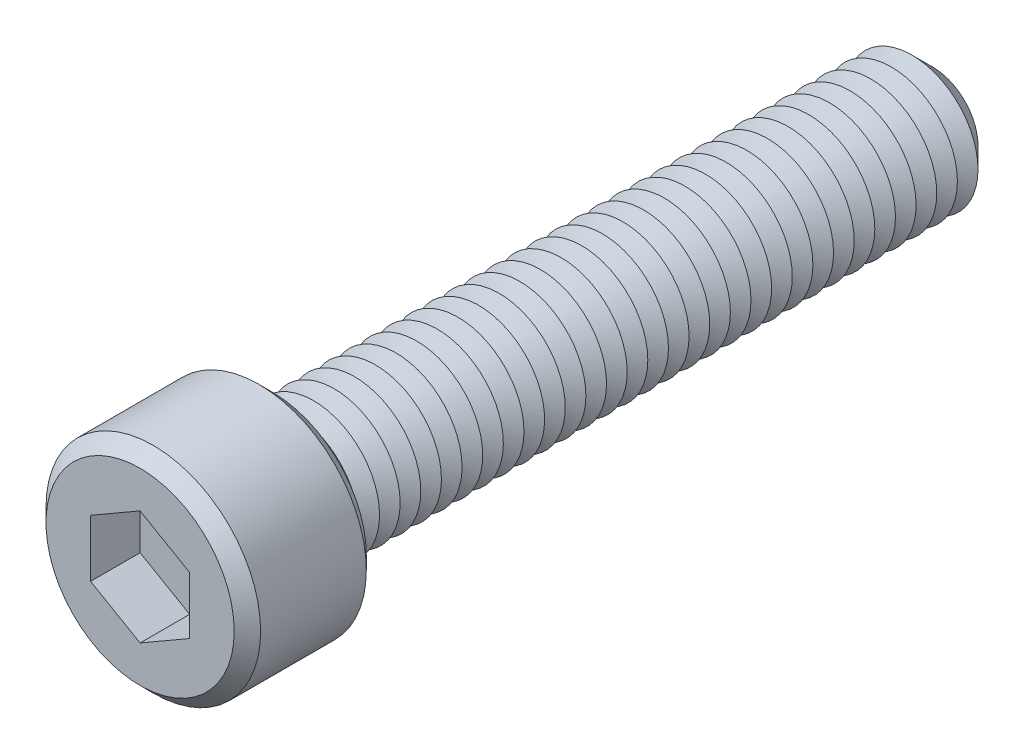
ISO-10303-21;
HEADER;
FILE_DESCRIPTION(('STEP AP214'),'2;1');
FILE_NAME('part.step','',(''),(''),'','','');
FILE_SCHEMA(('AUTOMOTIVE_DESIGN { 1 0 10303 214 1 1 1 1 }'));
ENDSEC;
DATA;
#1=APPLICATION_CONTEXT('core data for automotive mechanical design processes');
#2=APPLICATION_PROTOCOL_DEFINITION('international standard','automotive_design',2000,#1);
#3=PRODUCT_CONTEXT('',#1,'mechanical');
#4=PRODUCT('Part','Part','',(#3));
#5=PRODUCT_RELATED_PRODUCT_CATEGORY('part','',(#4));
#6=PRODUCT_DEFINITION_FORMATION('','',#4);
#7=PRODUCT_DEFINITION_CONTEXT('part definition',#1,'design');
#8=PRODUCT_DEFINITION('design','',#6,#7);
#9=PRODUCT_DEFINITION_SHAPE('','',#8);
#10=(LENGTH_UNIT() NAMED_UNIT(*) SI_UNIT(.MILLI.,.METRE.));
#11=(NAMED_UNIT(*) PLANE_ANGLE_UNIT() SI_UNIT($,.RADIAN.));
#12=(NAMED_UNIT(*) SI_UNIT($,.STERADIAN.) SOLID_ANGLE_UNIT());
#13=UNCERTAINTY_MEASURE_WITH_UNIT(LENGTH_MEASURE(1.E-05),#10,'distance_accuracy_value','');
#14=(GEOMETRIC_REPRESENTATION_CONTEXT(3) GLOBAL_UNCERTAINTY_ASSIGNED_CONTEXT((#13)) GLOBAL_UNIT_ASSIGNED_CONTEXT((#10,
#11,#12)) REPRESENTATION_CONTEXT('',''));
#15=CARTESIAN_POINT('',(0.,0.,0.));
#16=DIRECTION('',(0.,0.,1.));
#17=DIRECTION('',(1.,0.,0.));
#18=AXIS2_PLACEMENT_3D('',#15,#16,#17);
#19=CARTESIAN_POINT('',(0.,0.,8.));
#20=DIRECTION('',(0.,0.,-1.));
#21=DIRECTION('',(-1.,0.,0.));
#22=AXIS2_PLACEMENT_3D('',#19,#20,#21);
#23=CYLINDRICAL_SURFACE('',#22,6.5);
#24=CARTESIAN_POINT('',(0.,0.,0.799999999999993));
#25=DIRECTION('',(0.,0.,1.));
#26=DIRECTION('',(1.,0.,0.));
#27=AXIS2_PLACEMENT_3D('',#24,#25,#26);
#28=CIRCLE('',#27,6.5);
#29=CARTESIAN_POINT('',(6.5,0.,0.799999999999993));
#30=VERTEX_POINT('',#29);
#31=EDGE_CURVE('E425',#30,#30,#28,.T.);
#32=ORIENTED_EDGE('',*,*,#31,.T.);
#33=EDGE_LOOP('',(#32));
#34=FACE_BOUND('',#33,.T.);
#35=CARTESIAN_POINT('',(0.,0.,7.2));
#36=DIRECTION('',(0.,0.,1.));
#37=DIRECTION('',(1.,0.,0.));
#38=AXIS2_PLACEMENT_3D('',#35,#36,#37);
#39=CIRCLE('',#38,6.5);
#40=CARTESIAN_POINT('',(6.5,0.,7.2));
#41=VERTEX_POINT('',#40);
#42=EDGE_CURVE('E421',#41,#41,#39,.F.);
#43=ORIENTED_EDGE('',*,*,#42,.T.);
#44=EDGE_LOOP('',(#43));
#45=FACE_BOUND('',#44,.T.);
#46=ADVANCED_FACE('F39',(#34,#45),#23,.T.);
#47=CARTESIAN_POINT('',(0.,0.,8.));
#48=DIRECTION('',(0.,0.,1.));
#49=DIRECTION('',(1.,0.,0.));
#50=AXIS2_PLACEMENT_3D('',#47,#48,#49);
#51=PLANE('',#50);
#52=CARTESIAN_POINT('',(0.,0.,8.));
#53=DIRECTION('',(0.,0.,1.));
#54=DIRECTION('',(1.,0.,0.));
#55=AXIS2_PLACEMENT_3D('',#52,#53,#54);
#56=CIRCLE('',#55,5.7);
#57=CARTESIAN_POINT('',(5.7,0.,8.));
#58=VERTEX_POINT('',#57);
#59=EDGE_CURVE('E11',#58,#58,#56,.T.);
#60=ORIENTED_EDGE('',*,*,#59,.T.);
#61=EDGE_LOOP('',(#60));
#62=FACE_BOUND('',#61,.T.);
#63=DIRECTION('',(-0.866025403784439,0.5,0.));
#64=VECTOR('',#63,1.);
#65=CARTESIAN_POINT('',(3.,1.73205080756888,8.));
#66=LINE('',#65,#64);
#67=CARTESIAN_POINT('',(3.,1.73205080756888,8.));
#68=VERTEX_POINT('',#67);
#69=CARTESIAN_POINT('',(0.,3.46410161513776,8.));
#70=VERTEX_POINT('',#69);
#71=EDGE_CURVE('E55',#68,#70,#66,.T.);
#72=ORIENTED_EDGE('',*,*,#71,.F.);
#73=DIRECTION('',(0.,1.,0.));
#74=VECTOR('',#73,1.);
#75=CARTESIAN_POINT('',(3.,-1.73205080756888,8.));
#76=LINE('',#75,#74);
#77=CARTESIAN_POINT('',(3.,-1.73205080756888,8.));
#78=VERTEX_POINT('',#77);
#79=EDGE_CURVE('E151',#78,#68,#76,.T.);
#80=ORIENTED_EDGE('',*,*,#79,.F.);
#81=DIRECTION('',(0.866025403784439,0.5,0.));
#82=VECTOR('',#81,1.);
#83=CARTESIAN_POINT('',(0.,-3.46410161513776,8.));
#84=LINE('',#83,#82);
#85=CARTESIAN_POINT('',(0.,-3.46410161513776,8.));
#86=VERTEX_POINT('',#85);
#87=EDGE_CURVE('E148',#86,#78,#84,.T.);
#88=ORIENTED_EDGE('',*,*,#87,.F.);
#89=DIRECTION('',(0.866025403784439,-0.5,0.));
#90=VECTOR('',#89,1.);
#91=CARTESIAN_POINT('',(-3.,-1.73205080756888,8.));
#92=LINE('',#91,#90);
#93=CARTESIAN_POINT('',(-3.,-1.73205080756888,8.));
#94=VERTEX_POINT('',#93);
#95=EDGE_CURVE('E103',#94,#86,#92,.T.);
#96=ORIENTED_EDGE('',*,*,#95,.F.);
#97=DIRECTION('',(0.,-1.,0.));
#98=VECTOR('',#97,1.);
#99=CARTESIAN_POINT('',(-3.,1.73205080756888,8.));
#100=LINE('',#99,#98);
#101=CARTESIAN_POINT('',(-3.,1.73205080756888,8.));
#102=VERTEX_POINT('',#101);
#103=EDGE_CURVE('E142',#102,#94,#100,.T.);
#104=ORIENTED_EDGE('',*,*,#103,.F.);
#105=DIRECTION('',(-0.866025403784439,-0.5,0.));
#106=VECTOR('',#105,1.);
#107=CARTESIAN_POINT('',(0.,3.46410161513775,8.));
#108=LINE('',#107,#106);
#109=EDGE_CURVE('E137',#70,#102,#108,.T.);
#110=ORIENTED_EDGE('',*,*,#109,.F.);
#111=EDGE_LOOP('',(#72,#80,#88,#96,#104,#110));
#112=FACE_BOUND('',#111,.T.);
#113=ADVANCED_FACE('F443',(#62,#112),#51,.T.);
#114=CARTESIAN_POINT('',(0.,0.,0.));
#115=DIRECTION('',(0.,0.,1.));
#116=DIRECTION('',(1.,0.,0.));
#117=AXIS2_PLACEMENT_3D('',#114,#115,#116);
#118=PLANE('',#117);
#119=CARTESIAN_POINT('',(0.,0.,0.));
#120=DIRECTION('',(0.,0.,1.));
#121=DIRECTION('',(1.,0.,0.));
#122=AXIS2_PLACEMENT_3D('',#119,#120,#121);
#123=CIRCLE('',#122,5.7);
#124=CARTESIAN_POINT('',(5.7,0.,0.));
#125=VERTEX_POINT('',#124);
#126=EDGE_CURVE('E48',#125,#125,#123,.F.);
#127=ORIENTED_EDGE('',*,*,#126,.T.);
#128=EDGE_LOOP('',(#127));
#129=FACE_BOUND('',#128,.T.);
#130=CARTESIAN_POINT('',(0.,0.,0.));
#131=DIRECTION('',(0.,0.,1.));
#132=DIRECTION('',(1.,0.,0.));
#133=AXIS2_PLACEMENT_3D('',#130,#131,#132);
#134=CIRCLE('',#133,4.);
#135=CARTESIAN_POINT('',(4.,0.,0.));
#136=VERTEX_POINT('',#135);
#137=EDGE_CURVE('E413',#136,#136,#134,.T.);
#138=ORIENTED_EDGE('',*,*,#137,.T.);
#139=EDGE_LOOP('',(#138));
#140=FACE_BOUND('',#139,.T.);
#141=ADVANCED_FACE('F432',(#129,#140),#118,.F.);
#142=CARTESIAN_POINT('',(0.,0.,0.));
#143=DIRECTION('',(0.,0.,1.));
#144=DIRECTION('',(1.,0.,0.));
#145=AXIS2_PLACEMENT_3D('',#142,#143,#144);
#146=CONICAL_SURFACE('',#145,4.,1.0471975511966);
#147=CARTESIAN_POINT('',(0.,0.,-0.625));
#148=DIRECTION('',(0.,0.,1.));
#149=DIRECTION('',(1.,0.,0.));
#150=AXIS2_PLACEMENT_3D('',#147,#148,#149);
#151=CIRCLE('',#150,2.91746824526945);
#152=CARTESIAN_POINT('',(2.91746824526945,0.,-0.625));
#153=VERTEX_POINT('',#152);
#154=EDGE_CURVE('E409',#153,#153,#151,.T.);
#155=ORIENTED_EDGE('',*,*,#154,.T.);
#156=EDGE_LOOP('',(#155));
#157=FACE_BOUND('',#156,.T.);
#158=ORIENTED_EDGE('',*,*,#137,.F.);
#159=EDGE_LOOP('',(#158));
#160=FACE_BOUND('',#159,.T.);
#161=ADVANCED_FACE('F740',(#157,#160),#146,.T.);
#162=CARTESIAN_POINT('',(0.,0.,-0.625));
#163=DIRECTION('',(0.,0.,-1.));
#164=DIRECTION('',(-1.,0.,0.));
#165=AXIS2_PLACEMENT_3D('',#162,#163,#164);
#166=CONICAL_SURFACE('',#165,2.91746824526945,1.0471975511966);
#167=CARTESIAN_POINT('',(0.,0.,-1.25));
#168=DIRECTION('',(0.,0.,1.));
#169=DIRECTION('',(1.,0.,0.));
#170=AXIS2_PLACEMENT_3D('',#167,#168,#169);
#171=CIRCLE('',#170,4.);
#172=CARTESIAN_POINT('',(4.,0.,-1.25));
#173=VERTEX_POINT('',#172);
#174=EDGE_CURVE('E405',#173,#173,#171,.T.);
#175=ORIENTED_EDGE('',*,*,#174,.T.);
#176=EDGE_LOOP('',(#175));
#177=FACE_BOUND('',#176,.T.);
#178=ORIENTED_EDGE('',*,*,#154,.F.);
#179=EDGE_LOOP('',(#178));
#180=FACE_BOUND('',#179,.T.);
#181=ADVANCED_FACE('F736',(#177,#180),#166,.T.);
#182=CARTESIAN_POINT('',(0.,0.,-1.25));
#183=DIRECTION('',(0.,0.,1.));
#184=DIRECTION('',(1.,0.,0.));
#185=AXIS2_PLACEMENT_3D('',#182,#183,#184);
#186=CONICAL_SURFACE('',#185,4.,1.0471975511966);
#187=CARTESIAN_POINT('',(0.,0.,-1.875));
#188=DIRECTION('',(0.,0.,1.));
#189=DIRECTION('',(1.,0.,0.));
#190=AXIS2_PLACEMENT_3D('',#187,#188,#189);
#191=CIRCLE('',#190,2.91746824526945);
#192=CARTESIAN_POINT('',(2.91746824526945,0.,-1.875));
#193=VERTEX_POINT('',#192);
#194=EDGE_CURVE('E401',#193,#193,#191,.T.);
#195=ORIENTED_EDGE('',*,*,#194,.T.);
#196=EDGE_LOOP('',(#195));
#197=FACE_BOUND('',#196,.T.);
#198=ORIENTED_EDGE('',*,*,#174,.F.);
#199=EDGE_LOOP('',(#198));
#200=FACE_BOUND('',#199,.T.);
#201=ADVANCED_FACE('F732',(#197,#200),#186,.T.);
#202=CARTESIAN_POINT('',(0.,0.,-1.875));
#203=DIRECTION('',(0.,0.,-1.));
#204=DIRECTION('',(-1.,0.,0.));
#205=AXIS2_PLACEMENT_3D('',#202,#203,#204);
#206=CONICAL_SURFACE('',#205,2.91746824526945,1.0471975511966);
#207=CARTESIAN_POINT('',(0.,0.,-2.5));
#208=DIRECTION('',(0.,0.,1.));
#209=DIRECTION('',(1.,0.,0.));
#210=AXIS2_PLACEMENT_3D('',#207,#208,#209);
#211=CIRCLE('',#210,4.);
#212=CARTESIAN_POINT('',(4.,0.,-2.5));
#213=VERTEX_POINT('',#212);
#214=EDGE_CURVE('E397',#213,#213,#211,.T.);
#215=ORIENTED_EDGE('',*,*,#214,.T.);
#216=EDGE_LOOP('',(#215));
#217=FACE_BOUND('',#216,.T.);
#218=ORIENTED_EDGE('',*,*,#194,.F.);
#219=EDGE_LOOP('',(#218));
#220=FACE_BOUND('',#219,.T.);
#221=ADVANCED_FACE('F728',(#217,#220),#206,.T.);
#222=CARTESIAN_POINT('',(0.,0.,-2.5));
#223=DIRECTION('',(0.,0.,1.));
#224=DIRECTION('',(1.,0.,0.));
#225=AXIS2_PLACEMENT_3D('',#222,#223,#224);
#226=CONICAL_SURFACE('',#225,4.,1.0471975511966);
#227=CARTESIAN_POINT('',(0.,0.,-3.125));
#228=DIRECTION('',(0.,0.,1.));
#229=DIRECTION('',(1.,0.,0.));
#230=AXIS2_PLACEMENT_3D('',#227,#228,#229);
#231=CIRCLE('',#230,2.91746824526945);
#232=CARTESIAN_POINT('',(2.91746824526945,0.,-3.125));
#233=VERTEX_POINT('',#232);
#234=EDGE_CURVE('E393',#233,#233,#231,.T.);
#235=ORIENTED_EDGE('',*,*,#234,.T.);
#236=EDGE_LOOP('',(#235));
#237=FACE_BOUND('',#236,.T.);
#238=ORIENTED_EDGE('',*,*,#214,.F.);
#239=EDGE_LOOP('',(#238));
#240=FACE_BOUND('',#239,.T.);
#241=ADVANCED_FACE('F724',(#237,#240),#226,.T.);
#242=CARTESIAN_POINT('',(0.,0.,-3.125));
#243=DIRECTION('',(0.,0.,-1.));
#244=DIRECTION('',(-1.,0.,0.));
#245=AXIS2_PLACEMENT_3D('',#242,#243,#244);
#246=CONICAL_SURFACE('',#245,2.91746824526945,1.0471975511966);
#247=CARTESIAN_POINT('',(0.,0.,-3.75));
#248=DIRECTION('',(0.,0.,1.));
#249=DIRECTION('',(1.,0.,0.));
#250=AXIS2_PLACEMENT_3D('',#247,#248,#249);
#251=CIRCLE('',#250,4.);
#252=CARTESIAN_POINT('',(4.,0.,-3.75));
#253=VERTEX_POINT('',#252);
#254=EDGE_CURVE('E389',#253,#253,#251,.T.);
#255=ORIENTED_EDGE('',*,*,#254,.T.);
#256=EDGE_LOOP('',(#255));
#257=FACE_BOUND('',#256,.T.);
#258=ORIENTED_EDGE('',*,*,#234,.F.);
#259=EDGE_LOOP('',(#258));
#260=FACE_BOUND('',#259,.T.);
#261=ADVANCED_FACE('F720',(#257,#260),#246,.T.);
#262=CARTESIAN_POINT('',(0.,0.,-3.75));
#263=DIRECTION('',(0.,0.,1.));
#264=DIRECTION('',(1.,0.,0.));
#265=AXIS2_PLACEMENT_3D('',#262,#263,#264);
#266=CONICAL_SURFACE('',#265,4.,1.0471975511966);
#267=CARTESIAN_POINT('',(0.,0.,-4.375));
#268=DIRECTION('',(0.,0.,1.));
#269=DIRECTION('',(1.,0.,0.));
#270=AXIS2_PLACEMENT_3D('',#267,#268,#269);
#271=CIRCLE('',#270,2.91746824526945);
#272=CARTESIAN_POINT('',(2.91746824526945,0.,-4.375));
#273=VERTEX_POINT('',#272);
#274=EDGE_CURVE('E385',#273,#273,#271,.T.);
#275=ORIENTED_EDGE('',*,*,#274,.T.);
#276=EDGE_LOOP('',(#275));
#277=FACE_BOUND('',#276,.T.);
#278=ORIENTED_EDGE('',*,*,#254,.F.);
#279=EDGE_LOOP('',(#278));
#280=FACE_BOUND('',#279,.T.);
#281=ADVANCED_FACE('F716',(#277,#280),#266,.T.);
#282=CARTESIAN_POINT('',(0.,0.,-4.375));
#283=DIRECTION('',(0.,0.,-1.));
#284=DIRECTION('',(-1.,0.,0.));
#285=AXIS2_PLACEMENT_3D('',#282,#283,#284);
#286=CONICAL_SURFACE('',#285,2.91746824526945,1.0471975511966);
#287=CARTESIAN_POINT('',(0.,0.,-5.));
#288=DIRECTION('',(0.,0.,1.));
#289=DIRECTION('',(1.,0.,0.));
#290=AXIS2_PLACEMENT_3D('',#287,#288,#289);
#291=CIRCLE('',#290,4.);
#292=CARTESIAN_POINT('',(4.,0.,-5.));
#293=VERTEX_POINT('',#292);
#294=EDGE_CURVE('E381',#293,#293,#291,.T.);
#295=ORIENTED_EDGE('',*,*,#294,.T.);
#296=EDGE_LOOP('',(#295));
#297=FACE_BOUND('',#296,.T.);
#298=ORIENTED_EDGE('',*,*,#274,.F.);
#299=EDGE_LOOP('',(#298));
#300=FACE_BOUND('',#299,.T.);
#301=ADVANCED_FACE('F712',(#297,#300),#286,.T.);
#302=CARTESIAN_POINT('',(0.,0.,-5.));
#303=DIRECTION('',(0.,0.,1.));
#304=DIRECTION('',(1.,0.,0.));
#305=AXIS2_PLACEMENT_3D('',#302,#303,#304);
#306=CONICAL_SURFACE('',#305,4.,1.0471975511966);
#307=CARTESIAN_POINT('',(0.,0.,-5.625));
#308=DIRECTION('',(0.,0.,1.));
#309=DIRECTION('',(1.,0.,0.));
#310=AXIS2_PLACEMENT_3D('',#307,#308,#309);
#311=CIRCLE('',#310,2.91746824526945);
#312=CARTESIAN_POINT('',(2.91746824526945,0.,-5.625));
#313=VERTEX_POINT('',#312);
#314=EDGE_CURVE('E377',#313,#313,#311,.T.);
#315=ORIENTED_EDGE('',*,*,#314,.T.);
#316=EDGE_LOOP('',(#315));
#317=FACE_BOUND('',#316,.T.);
#318=ORIENTED_EDGE('',*,*,#294,.F.);
#319=EDGE_LOOP('',(#318));
#320=FACE_BOUND('',#319,.T.);
#321=ADVANCED_FACE('F708',(#317,#320),#306,.T.);
#322=CARTESIAN_POINT('',(0.,0.,-5.625));
#323=DIRECTION('',(0.,0.,-1.));
#324=DIRECTION('',(-1.,0.,0.));
#325=AXIS2_PLACEMENT_3D('',#322,#323,#324);
#326=CONICAL_SURFACE('',#325,2.91746824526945,1.0471975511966);
#327=CARTESIAN_POINT('',(0.,0.,-6.25));
#328=DIRECTION('',(0.,0.,1.));
#329=DIRECTION('',(1.,0.,0.));
#330=AXIS2_PLACEMENT_3D('',#327,#328,#329);
#331=CIRCLE('',#330,4.);
#332=CARTESIAN_POINT('',(4.,0.,-6.25));
#333=VERTEX_POINT('',#332);
#334=EDGE_CURVE('E373',#333,#333,#331,.T.);
#335=ORIENTED_EDGE('',*,*,#334,.T.);
#336=EDGE_LOOP('',(#335));
#337=FACE_BOUND('',#336,.T.);
#338=ORIENTED_EDGE('',*,*,#314,.F.);
#339=EDGE_LOOP('',(#338));
#340=FACE_BOUND('',#339,.T.);
#341=ADVANCED_FACE('F704',(#337,#340),#326,.T.);
#342=CARTESIAN_POINT('',(0.,0.,-6.25));
#343=DIRECTION('',(0.,0.,1.));
#344=DIRECTION('',(1.,0.,0.));
#345=AXIS2_PLACEMENT_3D('',#342,#343,#344);
#346=CONICAL_SURFACE('',#345,4.,1.0471975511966);
#347=CARTESIAN_POINT('',(0.,0.,-6.875));
#348=DIRECTION('',(0.,0.,1.));
#349=DIRECTION('',(1.,0.,0.));
#350=AXIS2_PLACEMENT_3D('',#347,#348,#349);
#351=CIRCLE('',#350,2.91746824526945);
#352=CARTESIAN_POINT('',(2.91746824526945,0.,-6.875));
#353=VERTEX_POINT('',#352);
#354=EDGE_CURVE('E369',#353,#353,#351,.T.);
#355=ORIENTED_EDGE('',*,*,#354,.T.);
#356=EDGE_LOOP('',(#355));
#357=FACE_BOUND('',#356,.T.);
#358=ORIENTED_EDGE('',*,*,#334,.F.);
#359=EDGE_LOOP('',(#358));
#360=FACE_BOUND('',#359,.T.);
#361=ADVANCED_FACE('F700',(#357,#360),#346,.T.);
#362=CARTESIAN_POINT('',(0.,0.,-6.875));
#363=DIRECTION('',(0.,0.,-1.));
#364=DIRECTION('',(-1.,0.,0.));
#365=AXIS2_PLACEMENT_3D('',#362,#363,#364);
#366=CONICAL_SURFACE('',#365,2.91746824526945,1.0471975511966);
#367=CARTESIAN_POINT('',(0.,0.,-7.5));
#368=DIRECTION('',(0.,0.,1.));
#369=DIRECTION('',(1.,0.,0.));
#370=AXIS2_PLACEMENT_3D('',#367,#368,#369);
#371=CIRCLE('',#370,4.);
#372=CARTESIAN_POINT('',(4.,0.,-7.5));
#373=VERTEX_POINT('',#372);
#374=EDGE_CURVE('E365',#373,#373,#371,.T.);
#375=ORIENTED_EDGE('',*,*,#374,.T.);
#376=EDGE_LOOP('',(#375));
#377=FACE_BOUND('',#376,.T.);
#378=ORIENTED_EDGE('',*,*,#354,.F.);
#379=EDGE_LOOP('',(#378));
#380=FACE_BOUND('',#379,.T.);
#381=ADVANCED_FACE('F696',(#377,#380),#366,.T.);
#382=CARTESIAN_POINT('',(0.,0.,-7.5));
#383=DIRECTION('',(0.,0.,1.));
#384=DIRECTION('',(1.,0.,0.));
#385=AXIS2_PLACEMENT_3D('',#382,#383,#384);
#386=CONICAL_SURFACE('',#385,4.,1.0471975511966);
#387=CARTESIAN_POINT('',(0.,0.,-8.125));
#388=DIRECTION('',(0.,0.,1.));
#389=DIRECTION('',(1.,0.,0.));
#390=AXIS2_PLACEMENT_3D('',#387,#388,#389);
#391=CIRCLE('',#390,2.91746824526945);
#392=CARTESIAN_POINT('',(2.91746824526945,0.,-8.125));
#393=VERTEX_POINT('',#392);
#394=EDGE_CURVE('E361',#393,#393,#391,.T.);
#395=ORIENTED_EDGE('',*,*,#394,.T.);
#396=EDGE_LOOP('',(#395));
#397=FACE_BOUND('',#396,.T.);
#398=ORIENTED_EDGE('',*,*,#374,.F.);
#399=EDGE_LOOP('',(#398));
#400=FACE_BOUND('',#399,.T.);
#401=ADVANCED_FACE('F692',(#397,#400),#386,.T.);
#402=CARTESIAN_POINT('',(0.,0.,-8.125));
#403=DIRECTION('',(0.,0.,-1.));
#404=DIRECTION('',(-1.,0.,0.));
#405=AXIS2_PLACEMENT_3D('',#402,#403,#404);
#406=CONICAL_SURFACE('',#405,2.91746824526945,1.0471975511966);
#407=CARTESIAN_POINT('',(0.,0.,-8.75));
#408=DIRECTION('',(0.,0.,1.));
#409=DIRECTION('',(1.,0.,0.));
#410=AXIS2_PLACEMENT_3D('',#407,#408,#409);
#411=CIRCLE('',#410,4.);
#412=CARTESIAN_POINT('',(4.,0.,-8.75));
#413=VERTEX_POINT('',#412);
#414=EDGE_CURVE('E357',#413,#413,#411,.T.);
#415=ORIENTED_EDGE('',*,*,#414,.T.);
#416=EDGE_LOOP('',(#415));
#417=FACE_BOUND('',#416,.T.);
#418=ORIENTED_EDGE('',*,*,#394,.F.);
#419=EDGE_LOOP('',(#418));
#420=FACE_BOUND('',#419,.T.);
#421=ADVANCED_FACE('F688',(#417,#420),#406,.T.);
#422=CARTESIAN_POINT('',(0.,0.,-8.75));
#423=DIRECTION('',(0.,0.,1.));
#424=DIRECTION('',(1.,0.,0.));
#425=AXIS2_PLACEMENT_3D('',#422,#423,#424);
#426=CONICAL_SURFACE('',#425,4.,1.0471975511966);
#427=CARTESIAN_POINT('',(0.,0.,-9.375));
#428=DIRECTION('',(0.,0.,1.));
#429=DIRECTION('',(1.,0.,0.));
#430=AXIS2_PLACEMENT_3D('',#427,#428,#429);
#431=CIRCLE('',#430,2.91746824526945);
#432=CARTESIAN_POINT('',(2.91746824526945,0.,-9.375));
#433=VERTEX_POINT('',#432);
#434=EDGE_CURVE('E353',#433,#433,#431,.T.);
#435=ORIENTED_EDGE('',*,*,#434,.T.);
#436=EDGE_LOOP('',(#435));
#437=FACE_BOUND('',#436,.T.);
#438=ORIENTED_EDGE('',*,*,#414,.F.);
#439=EDGE_LOOP('',(#438));
#440=FACE_BOUND('',#439,.T.);
#441=ADVANCED_FACE('F684',(#437,#440),#426,.T.);
#442=CARTESIAN_POINT('',(0.,0.,-9.375));
#443=DIRECTION('',(0.,0.,-1.));
#444=DIRECTION('',(-1.,0.,0.));
#445=AXIS2_PLACEMENT_3D('',#442,#443,#444);
#446=CONICAL_SURFACE('',#445,2.91746824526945,1.0471975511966);
#447=CARTESIAN_POINT('',(0.,0.,-10.));
#448=DIRECTION('',(0.,0.,1.));
#449=DIRECTION('',(1.,0.,0.));
#450=AXIS2_PLACEMENT_3D('',#447,#448,#449);
#451=CIRCLE('',#450,4.);
#452=CARTESIAN_POINT('',(4.,0.,-10.));
#453=VERTEX_POINT('',#452);
#454=EDGE_CURVE('E349',#453,#453,#451,.T.);
#455=ORIENTED_EDGE('',*,*,#454,.T.);
#456=EDGE_LOOP('',(#455));
#457=FACE_BOUND('',#456,.T.);
#458=ORIENTED_EDGE('',*,*,#434,.F.);
#459=EDGE_LOOP('',(#458));
#460=FACE_BOUND('',#459,.T.);
#461=ADVANCED_FACE('F680',(#457,#460),#446,.T.);
#462=CARTESIAN_POINT('',(0.,0.,-10.));
#463=DIRECTION('',(0.,0.,1.));
#464=DIRECTION('',(1.,0.,0.));
#465=AXIS2_PLACEMENT_3D('',#462,#463,#464);
#466=CONICAL_SURFACE('',#465,4.,1.0471975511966);
#467=CARTESIAN_POINT('',(0.,0.,-10.625));
#468=DIRECTION('',(0.,0.,1.));
#469=DIRECTION('',(1.,0.,0.));
#470=AXIS2_PLACEMENT_3D('',#467,#468,#469);
#471=CIRCLE('',#470,2.91746824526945);
#472=CARTESIAN_POINT('',(2.91746824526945,0.,-10.625));
#473=VERTEX_POINT('',#472);
#474=EDGE_CURVE('E345',#473,#473,#471,.T.);
#475=ORIENTED_EDGE('',*,*,#474,.T.);
#476=EDGE_LOOP('',(#475));
#477=FACE_BOUND('',#476,.T.);
#478=ORIENTED_EDGE('',*,*,#454,.F.);
#479=EDGE_LOOP('',(#478));
#480=FACE_BOUND('',#479,.T.);
#481=ADVANCED_FACE('F676',(#477,#480),#466,.T.);
#482=CARTESIAN_POINT('',(0.,0.,-10.625));
#483=DIRECTION('',(0.,0.,-1.));
#484=DIRECTION('',(-1.,0.,0.));
#485=AXIS2_PLACEMENT_3D('',#482,#483,#484);
#486=CONICAL_SURFACE('',#485,2.91746824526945,1.0471975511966);
#487=CARTESIAN_POINT('',(0.,0.,-11.25));
#488=DIRECTION('',(0.,0.,1.));
#489=DIRECTION('',(1.,0.,0.));
#490=AXIS2_PLACEMENT_3D('',#487,#488,#489);
#491=CIRCLE('',#490,4.);
#492=CARTESIAN_POINT('',(4.,0.,-11.25));
#493=VERTEX_POINT('',#492);
#494=EDGE_CURVE('E341',#493,#493,#491,.T.);
#495=ORIENTED_EDGE('',*,*,#494,.T.);
#496=EDGE_LOOP('',(#495));
#497=FACE_BOUND('',#496,.T.);
#498=ORIENTED_EDGE('',*,*,#474,.F.);
#499=EDGE_LOOP('',(#498));
#500=FACE_BOUND('',#499,.T.);
#501=ADVANCED_FACE('F672',(#497,#500),#486,.T.);
#502=CARTESIAN_POINT('',(0.,0.,-11.25));
#503=DIRECTION('',(0.,0.,1.));
#504=DIRECTION('',(1.,0.,0.));
#505=AXIS2_PLACEMENT_3D('',#502,#503,#504);
#506=CONICAL_SURFACE('',#505,4.,1.0471975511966);
#507=CARTESIAN_POINT('',(0.,0.,-11.875));
#508=DIRECTION('',(0.,0.,1.));
#509=DIRECTION('',(1.,0.,0.));
#510=AXIS2_PLACEMENT_3D('',#507,#508,#509);
#511=CIRCLE('',#510,2.91746824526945);
#512=CARTESIAN_POINT('',(2.91746824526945,0.,-11.875));
#513=VERTEX_POINT('',#512);
#514=EDGE_CURVE('E337',#513,#513,#511,.T.);
#515=ORIENTED_EDGE('',*,*,#514,.T.);
#516=EDGE_LOOP('',(#515));
#517=FACE_BOUND('',#516,.T.);
#518=ORIENTED_EDGE('',*,*,#494,.F.);
#519=EDGE_LOOP('',(#518));
#520=FACE_BOUND('',#519,.T.);
#521=ADVANCED_FACE('F668',(#517,#520),#506,.T.);
#522=CARTESIAN_POINT('',(0.,0.,-11.875));
#523=DIRECTION('',(0.,0.,-1.));
#524=DIRECTION('',(-1.,0.,0.));
#525=AXIS2_PLACEMENT_3D('',#522,#523,#524);
#526=CONICAL_SURFACE('',#525,2.91746824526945,1.0471975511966);
#527=CARTESIAN_POINT('',(0.,0.,-12.5));
#528=DIRECTION('',(0.,0.,1.));
#529=DIRECTION('',(1.,0.,0.));
#530=AXIS2_PLACEMENT_3D('',#527,#528,#529);
#531=CIRCLE('',#530,4.);
#532=CARTESIAN_POINT('',(4.,0.,-12.5));
#533=VERTEX_POINT('',#532);
#534=EDGE_CURVE('E333',#533,#533,#531,.T.);
#535=ORIENTED_EDGE('',*,*,#534,.T.);
#536=EDGE_LOOP('',(#535));
#537=FACE_BOUND('',#536,.T.);
#538=ORIENTED_EDGE('',*,*,#514,.F.);
#539=EDGE_LOOP('',(#538));
#540=FACE_BOUND('',#539,.T.);
#541=ADVANCED_FACE('F664',(#537,#540),#526,.T.);
#542=CARTESIAN_POINT('',(0.,0.,-12.5));
#543=DIRECTION('',(0.,0.,1.));
#544=DIRECTION('',(1.,0.,0.));
#545=AXIS2_PLACEMENT_3D('',#542,#543,#544);
#546=CONICAL_SURFACE('',#545,4.,1.0471975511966);
#547=CARTESIAN_POINT('',(0.,0.,-13.125));
#548=DIRECTION('',(0.,0.,1.));
#549=DIRECTION('',(1.,0.,0.));
#550=AXIS2_PLACEMENT_3D('',#547,#548,#549);
#551=CIRCLE('',#550,2.91746824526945);
#552=CARTESIAN_POINT('',(2.91746824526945,0.,-13.125));
#553=VERTEX_POINT('',#552);
#554=EDGE_CURVE('E329',#553,#553,#551,.T.);
#555=ORIENTED_EDGE('',*,*,#554,.T.);
#556=EDGE_LOOP('',(#555));
#557=FACE_BOUND('',#556,.T.);
#558=ORIENTED_EDGE('',*,*,#534,.F.);
#559=EDGE_LOOP('',(#558));
#560=FACE_BOUND('',#559,.T.);
#561=ADVANCED_FACE('F660',(#557,#560),#546,.T.);
#562=CARTESIAN_POINT('',(0.,0.,-13.125));
#563=DIRECTION('',(0.,0.,-1.));
#564=DIRECTION('',(-1.,0.,0.));
#565=AXIS2_PLACEMENT_3D('',#562,#563,#564);
#566=CONICAL_SURFACE('',#565,2.91746824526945,1.0471975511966);
#567=CARTESIAN_POINT('',(0.,0.,-13.75));
#568=DIRECTION('',(0.,0.,1.));
#569=DIRECTION('',(1.,0.,0.));
#570=AXIS2_PLACEMENT_3D('',#567,#568,#569);
#571=CIRCLE('',#570,4.);
#572=CARTESIAN_POINT('',(4.,0.,-13.75));
#573=VERTEX_POINT('',#572);
#574=EDGE_CURVE('E325',#573,#573,#571,.T.);
#575=ORIENTED_EDGE('',*,*,#574,.T.);
#576=EDGE_LOOP('',(#575));
#577=FACE_BOUND('',#576,.T.);
#578=ORIENTED_EDGE('',*,*,#554,.F.);
#579=EDGE_LOOP('',(#578));
#580=FACE_BOUND('',#579,.T.);
#581=ADVANCED_FACE('F656',(#577,#580),#566,.T.);
#582=CARTESIAN_POINT('',(0.,0.,-13.75));
#583=DIRECTION('',(0.,0.,1.));
#584=DIRECTION('',(1.,0.,0.));
#585=AXIS2_PLACEMENT_3D('',#582,#583,#584);
#586=CONICAL_SURFACE('',#585,4.,1.0471975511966);
#587=CARTESIAN_POINT('',(0.,0.,-14.375));
#588=DIRECTION('',(0.,0.,1.));
#589=DIRECTION('',(1.,0.,0.));
#590=AXIS2_PLACEMENT_3D('',#587,#588,#589);
#591=CIRCLE('',#590,2.91746824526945);
#592=CARTESIAN_POINT('',(2.91746824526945,0.,-14.375));
#593=VERTEX_POINT('',#592);
#594=EDGE_CURVE('E321',#593,#593,#591,.T.);
#595=ORIENTED_EDGE('',*,*,#594,.T.);
#596=EDGE_LOOP('',(#595));
#597=FACE_BOUND('',#596,.T.);
#598=ORIENTED_EDGE('',*,*,#574,.F.);
#599=EDGE_LOOP('',(#598));
#600=FACE_BOUND('',#599,.T.);
#601=ADVANCED_FACE('F652',(#597,#600),#586,.T.);
#602=CARTESIAN_POINT('',(0.,0.,-14.375));
#603=DIRECTION('',(0.,0.,-1.));
#604=DIRECTION('',(-1.,0.,0.));
#605=AXIS2_PLACEMENT_3D('',#602,#603,#604);
#606=CONICAL_SURFACE('',#605,2.91746824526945,1.0471975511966);
#607=CARTESIAN_POINT('',(0.,0.,-15.));
#608=DIRECTION('',(0.,0.,1.));
#609=DIRECTION('',(1.,0.,0.));
#610=AXIS2_PLACEMENT_3D('',#607,#608,#609);
#611=CIRCLE('',#610,4.);
#612=CARTESIAN_POINT('',(4.,0.,-15.));
#613=VERTEX_POINT('',#612);
#614=EDGE_CURVE('E317',#613,#613,#611,.T.);
#615=ORIENTED_EDGE('',*,*,#614,.T.);
#616=EDGE_LOOP('',(#615));
#617=FACE_BOUND('',#616,.T.);
#618=ORIENTED_EDGE('',*,*,#594,.F.);
#619=EDGE_LOOP('',(#618));
#620=FACE_BOUND('',#619,.T.);
#621=ADVANCED_FACE('F648',(#617,#620),#606,.T.);
#622=CARTESIAN_POINT('',(0.,0.,-15.));
#623=DIRECTION('',(0.,0.,1.));
#624=DIRECTION('',(1.,0.,0.));
#625=AXIS2_PLACEMENT_3D('',#622,#623,#624);
#626=CONICAL_SURFACE('',#625,4.,1.0471975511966);
#627=CARTESIAN_POINT('',(0.,0.,-15.625));
#628=DIRECTION('',(0.,0.,1.));
#629=DIRECTION('',(1.,0.,0.));
#630=AXIS2_PLACEMENT_3D('',#627,#628,#629);
#631=CIRCLE('',#630,2.91746824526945);
#632=CARTESIAN_POINT('',(2.91746824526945,0.,-15.625));
#633=VERTEX_POINT('',#632);
#634=EDGE_CURVE('E313',#633,#633,#631,.T.);
#635=ORIENTED_EDGE('',*,*,#634,.T.);
#636=EDGE_LOOP('',(#635));
#637=FACE_BOUND('',#636,.T.);
#638=ORIENTED_EDGE('',*,*,#614,.F.);
#639=EDGE_LOOP('',(#638));
#640=FACE_BOUND('',#639,.T.);
#641=ADVANCED_FACE('F644',(#637,#640),#626,.T.);
#642=CARTESIAN_POINT('',(0.,0.,-15.625));
#643=DIRECTION('',(0.,0.,-1.));
#644=DIRECTION('',(-1.,0.,0.));
#645=AXIS2_PLACEMENT_3D('',#642,#643,#644);
#646=CONICAL_SURFACE('',#645,2.91746824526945,1.0471975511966);
#647=CARTESIAN_POINT('',(0.,0.,-16.25));
#648=DIRECTION('',(0.,0.,1.));
#649=DIRECTION('',(1.,0.,0.));
#650=AXIS2_PLACEMENT_3D('',#647,#648,#649);
#651=CIRCLE('',#650,4.);
#652=CARTESIAN_POINT('',(4.,0.,-16.25));
#653=VERTEX_POINT('',#652);
#654=EDGE_CURVE('E309',#653,#653,#651,.T.);
#655=ORIENTED_EDGE('',*,*,#654,.T.);
#656=EDGE_LOOP('',(#655));
#657=FACE_BOUND('',#656,.T.);
#658=ORIENTED_EDGE('',*,*,#634,.F.);
#659=EDGE_LOOP('',(#658));
#660=FACE_BOUND('',#659,.T.);
#661=ADVANCED_FACE('F640',(#657,#660),#646,.T.);
#662=CARTESIAN_POINT('',(0.,0.,-16.25));
#663=DIRECTION('',(0.,0.,1.));
#664=DIRECTION('',(1.,0.,0.));
#665=AXIS2_PLACEMENT_3D('',#662,#663,#664);
#666=CONICAL_SURFACE('',#665,4.,1.0471975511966);
#667=CARTESIAN_POINT('',(0.,0.,-16.875));
#668=DIRECTION('',(0.,0.,1.));
#669=DIRECTION('',(1.,0.,0.));
#670=AXIS2_PLACEMENT_3D('',#667,#668,#669);
#671=CIRCLE('',#670,2.91746824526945);
#672=CARTESIAN_POINT('',(2.91746824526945,0.,-16.875));
#673=VERTEX_POINT('',#672);
#674=EDGE_CURVE('E305',#673,#673,#671,.T.);
#675=ORIENTED_EDGE('',*,*,#674,.T.);
#676=EDGE_LOOP('',(#675));
#677=FACE_BOUND('',#676,.T.);
#678=ORIENTED_EDGE('',*,*,#654,.F.);
#679=EDGE_LOOP('',(#678));
#680=FACE_BOUND('',#679,.T.);
#681=ADVANCED_FACE('F636',(#677,#680),#666,.T.);
#682=CARTESIAN_POINT('',(0.,0.,-16.875));
#683=DIRECTION('',(0.,0.,-1.));
#684=DIRECTION('',(-1.,0.,0.));
#685=AXIS2_PLACEMENT_3D('',#682,#683,#684);
#686=CONICAL_SURFACE('',#685,2.91746824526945,1.0471975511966);
#687=CARTESIAN_POINT('',(0.,0.,-17.5));
#688=DIRECTION('',(0.,0.,1.));
#689=DIRECTION('',(1.,0.,0.));
#690=AXIS2_PLACEMENT_3D('',#687,#688,#689);
#691=CIRCLE('',#690,4.);
#692=CARTESIAN_POINT('',(4.,0.,-17.5));
#693=VERTEX_POINT('',#692);
#694=EDGE_CURVE('E301',#693,#693,#691,.T.);
#695=ORIENTED_EDGE('',*,*,#694,.T.);
#696=EDGE_LOOP('',(#695));
#697=FACE_BOUND('',#696,.T.);
#698=ORIENTED_EDGE('',*,*,#674,.F.);
#699=EDGE_LOOP('',(#698));
#700=FACE_BOUND('',#699,.T.);
#701=ADVANCED_FACE('F632',(#697,#700),#686,.T.);
#702=CARTESIAN_POINT('',(0.,0.,-17.5));
#703=DIRECTION('',(0.,0.,1.));
#704=DIRECTION('',(1.,0.,0.));
#705=AXIS2_PLACEMENT_3D('',#702,#703,#704);
#706=CONICAL_SURFACE('',#705,4.,1.0471975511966);
#707=CARTESIAN_POINT('',(0.,0.,-18.125));
#708=DIRECTION('',(0.,0.,1.));
#709=DIRECTION('',(1.,0.,0.));
#710=AXIS2_PLACEMENT_3D('',#707,#708,#709);
#711=CIRCLE('',#710,2.91746824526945);
#712=CARTESIAN_POINT('',(2.91746824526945,0.,-18.125));
#713=VERTEX_POINT('',#712);
#714=EDGE_CURVE('E297',#713,#713,#711,.T.);
#715=ORIENTED_EDGE('',*,*,#714,.T.);
#716=EDGE_LOOP('',(#715));
#717=FACE_BOUND('',#716,.T.);
#718=ORIENTED_EDGE('',*,*,#694,.F.);
#719=EDGE_LOOP('',(#718));
#720=FACE_BOUND('',#719,.T.);
#721=ADVANCED_FACE('F628',(#717,#720),#706,.T.);
#722=CARTESIAN_POINT('',(0.,0.,-18.125));
#723=DIRECTION('',(0.,0.,-1.));
#724=DIRECTION('',(-1.,0.,0.));
#725=AXIS2_PLACEMENT_3D('',#722,#723,#724);
#726=CONICAL_SURFACE('',#725,2.91746824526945,1.0471975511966);
#727=CARTESIAN_POINT('',(0.,0.,-18.75));
#728=DIRECTION('',(0.,0.,1.));
#729=DIRECTION('',(1.,0.,0.));
#730=AXIS2_PLACEMENT_3D('',#727,#728,#729);
#731=CIRCLE('',#730,4.);
#732=CARTESIAN_POINT('',(4.,0.,-18.75));
#733=VERTEX_POINT('',#732);
#734=EDGE_CURVE('E293',#733,#733,#731,.T.);
#735=ORIENTED_EDGE('',*,*,#734,.T.);
#736=EDGE_LOOP('',(#735));
#737=FACE_BOUND('',#736,.T.);
#738=ORIENTED_EDGE('',*,*,#714,.F.);
#739=EDGE_LOOP('',(#738));
#740=FACE_BOUND('',#739,.T.);
#741=ADVANCED_FACE('F624',(#737,#740),#726,.T.);
#742=CARTESIAN_POINT('',(0.,0.,-18.75));
#743=DIRECTION('',(0.,0.,1.));
#744=DIRECTION('',(1.,0.,0.));
#745=AXIS2_PLACEMENT_3D('',#742,#743,#744);
#746=CONICAL_SURFACE('',#745,4.,1.0471975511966);
#747=CARTESIAN_POINT('',(0.,0.,-19.375));
#748=DIRECTION('',(0.,0.,1.));
#749=DIRECTION('',(1.,0.,0.));
#750=AXIS2_PLACEMENT_3D('',#747,#748,#749);
#751=CIRCLE('',#750,2.91746824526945);
#752=CARTESIAN_POINT('',(2.91746824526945,0.,-19.375));
#753=VERTEX_POINT('',#752);
#754=EDGE_CURVE('E290',#753,#753,#751,.T.);
#755=ORIENTED_EDGE('',*,*,#754,.T.);
#756=EDGE_LOOP('',(#755));
#757=FACE_BOUND('',#756,.T.);
#758=ORIENTED_EDGE('',*,*,#734,.F.);
#759=EDGE_LOOP('',(#758));
#760=FACE_BOUND('',#759,.T.);
#761=ADVANCED_FACE('F620',(#757,#760),#746,.T.);
#762=CARTESIAN_POINT('',(0.,0.,-19.375));
#763=DIRECTION('',(0.,0.,-1.));
#764=DIRECTION('',(-1.,0.,0.));
#765=AXIS2_PLACEMENT_3D('',#762,#763,#764);
#766=CONICAL_SURFACE('',#765,2.91746824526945,1.0471975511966);
#767=CARTESIAN_POINT('',(0.,0.,-20.));
#768=DIRECTION('',(0.,0.,1.));
#769=DIRECTION('',(1.,0.,0.));
#770=AXIS2_PLACEMENT_3D('',#767,#768,#769);
#771=CIRCLE('',#770,4.);
#772=CARTESIAN_POINT('',(4.,0.,-20.));
#773=VERTEX_POINT('',#772);
#774=EDGE_CURVE('E286',#773,#773,#771,.T.);
#775=ORIENTED_EDGE('',*,*,#774,.T.);
#776=EDGE_LOOP('',(#775));
#777=FACE_BOUND('',#776,.T.);
#778=ORIENTED_EDGE('',*,*,#754,.F.);
#779=EDGE_LOOP('',(#778));
#780=FACE_BOUND('',#779,.T.);
#781=ADVANCED_FACE('F616',(#777,#780),#766,.T.);
#782=CARTESIAN_POINT('',(0.,0.,-20.));
#783=DIRECTION('',(0.,0.,1.));
#784=DIRECTION('',(1.,0.,0.));
#785=AXIS2_PLACEMENT_3D('',#782,#783,#784);
#786=CONICAL_SURFACE('',#785,4.,1.0471975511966);
#787=CARTESIAN_POINT('',(0.,0.,-20.625));
#788=DIRECTION('',(0.,0.,1.));
#789=DIRECTION('',(1.,0.,0.));
#790=AXIS2_PLACEMENT_3D('',#787,#788,#789);
#791=CIRCLE('',#790,2.91746824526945);
#792=CARTESIAN_POINT('',(2.91746824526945,0.,-20.625));
#793=VERTEX_POINT('',#792);
#794=EDGE_CURVE('E282',#793,#793,#791,.T.);
#795=ORIENTED_EDGE('',*,*,#794,.T.);
#796=EDGE_LOOP('',(#795));
#797=FACE_BOUND('',#796,.T.);
#798=ORIENTED_EDGE('',*,*,#774,.F.);
#799=EDGE_LOOP('',(#798));
#800=FACE_BOUND('',#799,.T.);
#801=ADVANCED_FACE('F612',(#797,#800),#786,.T.);
#802=CARTESIAN_POINT('',(0.,0.,-20.625));
#803=DIRECTION('',(0.,0.,-1.));
#804=DIRECTION('',(-1.,0.,0.));
#805=AXIS2_PLACEMENT_3D('',#802,#803,#804);
#806=CONICAL_SURFACE('',#805,2.91746824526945,1.0471975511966);
#807=CARTESIAN_POINT('',(0.,0.,-21.25));
#808=DIRECTION('',(0.,0.,1.));
#809=DIRECTION('',(1.,0.,0.));
#810=AXIS2_PLACEMENT_3D('',#807,#808,#809);
#811=CIRCLE('',#810,4.);
#812=CARTESIAN_POINT('',(4.,0.,-21.25));
#813=VERTEX_POINT('',#812);
#814=EDGE_CURVE('E278',#813,#813,#811,.T.);
#815=ORIENTED_EDGE('',*,*,#814,.T.);
#816=EDGE_LOOP('',(#815));
#817=FACE_BOUND('',#816,.T.);
#818=ORIENTED_EDGE('',*,*,#794,.F.);
#819=EDGE_LOOP('',(#818));
#820=FACE_BOUND('',#819,.T.);
#821=ADVANCED_FACE('F608',(#817,#820),#806,.T.);
#822=CARTESIAN_POINT('',(0.,0.,-21.25));
#823=DIRECTION('',(0.,0.,1.));
#824=DIRECTION('',(1.,0.,0.));
#825=AXIS2_PLACEMENT_3D('',#822,#823,#824);
#826=CONICAL_SURFACE('',#825,4.,1.0471975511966);
#827=CARTESIAN_POINT('',(0.,0.,-21.875));
#828=DIRECTION('',(0.,0.,1.));
#829=DIRECTION('',(1.,0.,0.));
#830=AXIS2_PLACEMENT_3D('',#827,#828,#829);
#831=CIRCLE('',#830,2.91746824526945);
#832=CARTESIAN_POINT('',(2.91746824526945,0.,-21.875));
#833=VERTEX_POINT('',#832);
#834=EDGE_CURVE('E274',#833,#833,#831,.T.);
#835=ORIENTED_EDGE('',*,*,#834,.T.);
#836=EDGE_LOOP('',(#835));
#837=FACE_BOUND('',#836,.T.);
#838=ORIENTED_EDGE('',*,*,#814,.F.);
#839=EDGE_LOOP('',(#838));
#840=FACE_BOUND('',#839,.T.);
#841=ADVANCED_FACE('F604',(#837,#840),#826,.T.);
#842=CARTESIAN_POINT('',(0.,0.,-21.875));
#843=DIRECTION('',(0.,0.,-1.));
#844=DIRECTION('',(-1.,0.,0.));
#845=AXIS2_PLACEMENT_3D('',#842,#843,#844);
#846=CONICAL_SURFACE('',#845,2.91746824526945,1.0471975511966);
#847=CARTESIAN_POINT('',(0.,0.,-22.5));
#848=DIRECTION('',(0.,0.,1.));
#849=DIRECTION('',(1.,0.,0.));
#850=AXIS2_PLACEMENT_3D('',#847,#848,#849);
#851=CIRCLE('',#850,4.);
#852=CARTESIAN_POINT('',(4.,0.,-22.5));
#853=VERTEX_POINT('',#852);
#854=EDGE_CURVE('E270',#853,#853,#851,.T.);
#855=ORIENTED_EDGE('',*,*,#854,.T.);
#856=EDGE_LOOP('',(#855));
#857=FACE_BOUND('',#856,.T.);
#858=ORIENTED_EDGE('',*,*,#834,.F.);
#859=EDGE_LOOP('',(#858));
#860=FACE_BOUND('',#859,.T.);
#861=ADVANCED_FACE('F600',(#857,#860),#846,.T.);
#862=CARTESIAN_POINT('',(0.,0.,-22.5));
#863=DIRECTION('',(0.,0.,1.));
#864=DIRECTION('',(1.,0.,0.));
#865=AXIS2_PLACEMENT_3D('',#862,#863,#864);
#866=CONICAL_SURFACE('',#865,4.,1.0471975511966);
#867=CARTESIAN_POINT('',(0.,0.,-23.125));
#868=DIRECTION('',(0.,0.,1.));
#869=DIRECTION('',(1.,0.,0.));
#870=AXIS2_PLACEMENT_3D('',#867,#868,#869);
#871=CIRCLE('',#870,2.91746824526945);
#872=CARTESIAN_POINT('',(2.91746824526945,0.,-23.125));
#873=VERTEX_POINT('',#872);
#874=EDGE_CURVE('E266',#873,#873,#871,.T.);
#875=ORIENTED_EDGE('',*,*,#874,.T.);
#876=EDGE_LOOP('',(#875));
#877=FACE_BOUND('',#876,.T.);
#878=ORIENTED_EDGE('',*,*,#854,.F.);
#879=EDGE_LOOP('',(#878));
#880=FACE_BOUND('',#879,.T.);
#881=ADVANCED_FACE('F596',(#877,#880),#866,.T.);
#882=CARTESIAN_POINT('',(0.,0.,-23.125));
#883=DIRECTION('',(0.,0.,-1.));
#884=DIRECTION('',(-1.,0.,0.));
#885=AXIS2_PLACEMENT_3D('',#882,#883,#884);
#886=CONICAL_SURFACE('',#885,2.91746824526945,1.0471975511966);
#887=CARTESIAN_POINT('',(0.,0.,-23.75));
#888=DIRECTION('',(0.,0.,1.));
#889=DIRECTION('',(1.,0.,0.));
#890=AXIS2_PLACEMENT_3D('',#887,#888,#889);
#891=CIRCLE('',#890,4.);
#892=CARTESIAN_POINT('',(4.,0.,-23.75));
#893=VERTEX_POINT('',#892);
#894=EDGE_CURVE('E262',#893,#893,#891,.T.);
#895=ORIENTED_EDGE('',*,*,#894,.T.);
#896=EDGE_LOOP('',(#895));
#897=FACE_BOUND('',#896,.T.);
#898=ORIENTED_EDGE('',*,*,#874,.F.);
#899=EDGE_LOOP('',(#898));
#900=FACE_BOUND('',#899,.T.);
#901=ADVANCED_FACE('F592',(#897,#900),#886,.T.);
#902=CARTESIAN_POINT('',(0.,0.,-23.75));
#903=DIRECTION('',(0.,0.,1.));
#904=DIRECTION('',(1.,0.,0.));
#905=AXIS2_PLACEMENT_3D('',#902,#903,#904);
#906=CONICAL_SURFACE('',#905,4.,1.0471975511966);
#907=CARTESIAN_POINT('',(0.,0.,-24.375));
#908=DIRECTION('',(0.,0.,1.));
#909=DIRECTION('',(1.,0.,0.));
#910=AXIS2_PLACEMENT_3D('',#907,#908,#909);
#911=CIRCLE('',#910,2.91746824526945);
#912=CARTESIAN_POINT('',(2.91746824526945,0.,-24.375));
#913=VERTEX_POINT('',#912);
#914=EDGE_CURVE('E258',#913,#913,#911,.T.);
#915=ORIENTED_EDGE('',*,*,#914,.T.);
#916=EDGE_LOOP('',(#915));
#917=FACE_BOUND('',#916,.T.);
#918=ORIENTED_EDGE('',*,*,#894,.F.);
#919=EDGE_LOOP('',(#918));
#920=FACE_BOUND('',#919,.T.);
#921=ADVANCED_FACE('F588',(#917,#920),#906,.T.);
#922=CARTESIAN_POINT('',(0.,0.,-24.375));
#923=DIRECTION('',(0.,0.,-1.));
#924=DIRECTION('',(-1.,0.,0.));
#925=AXIS2_PLACEMENT_3D('',#922,#923,#924);
#926=CONICAL_SURFACE('',#925,2.91746824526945,1.0471975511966);
#927=CARTESIAN_POINT('',(0.,0.,-25.));
#928=DIRECTION('',(0.,0.,1.));
#929=DIRECTION('',(1.,0.,0.));
#930=AXIS2_PLACEMENT_3D('',#927,#928,#929);
#931=CIRCLE('',#930,4.);
#932=CARTESIAN_POINT('',(4.,0.,-25.));
#933=VERTEX_POINT('',#932);
#934=EDGE_CURVE('E254',#933,#933,#931,.T.);
#935=ORIENTED_EDGE('',*,*,#934,.T.);
#936=EDGE_LOOP('',(#935));
#937=FACE_BOUND('',#936,.T.);
#938=ORIENTED_EDGE('',*,*,#914,.F.);
#939=EDGE_LOOP('',(#938));
#940=FACE_BOUND('',#939,.T.);
#941=ADVANCED_FACE('F584',(#937,#940),#926,.T.);
#942=CARTESIAN_POINT('',(0.,0.,-25.));
#943=DIRECTION('',(0.,0.,1.));
#944=DIRECTION('',(1.,0.,0.));
#945=AXIS2_PLACEMENT_3D('',#942,#943,#944);
#946=CONICAL_SURFACE('',#945,4.,1.0471975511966);
#947=CARTESIAN_POINT('',(0.,0.,-25.625));
#948=DIRECTION('',(0.,0.,1.));
#949=DIRECTION('',(1.,0.,0.));
#950=AXIS2_PLACEMENT_3D('',#947,#948,#949);
#951=CIRCLE('',#950,2.91746824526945);
#952=CARTESIAN_POINT('',(2.91746824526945,0.,-25.625));
#953=VERTEX_POINT('',#952);
#954=EDGE_CURVE('E250',#953,#953,#951,.T.);
#955=ORIENTED_EDGE('',*,*,#954,.T.);
#956=EDGE_LOOP('',(#955));
#957=FACE_BOUND('',#956,.T.);
#958=ORIENTED_EDGE('',*,*,#934,.F.);
#959=EDGE_LOOP('',(#958));
#960=FACE_BOUND('',#959,.T.);
#961=ADVANCED_FACE('F580',(#957,#960),#946,.T.);
#962=CARTESIAN_POINT('',(0.,0.,-25.625));
#963=DIRECTION('',(0.,0.,-1.));
#964=DIRECTION('',(-1.,0.,0.));
#965=AXIS2_PLACEMENT_3D('',#962,#963,#964);
#966=CONICAL_SURFACE('',#965,2.91746824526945,1.0471975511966);
#967=CARTESIAN_POINT('',(0.,0.,-26.25));
#968=DIRECTION('',(0.,0.,1.));
#969=DIRECTION('',(1.,0.,0.));
#970=AXIS2_PLACEMENT_3D('',#967,#968,#969);
#971=CIRCLE('',#970,4.);
#972=CARTESIAN_POINT('',(4.,0.,-26.25));
#973=VERTEX_POINT('',#972);
#974=EDGE_CURVE('E246',#973,#973,#971,.T.);
#975=ORIENTED_EDGE('',*,*,#974,.T.);
#976=EDGE_LOOP('',(#975));
#977=FACE_BOUND('',#976,.T.);
#978=ORIENTED_EDGE('',*,*,#954,.F.);
#979=EDGE_LOOP('',(#978));
#980=FACE_BOUND('',#979,.T.);
#981=ADVANCED_FACE('F576',(#977,#980),#966,.T.);
#982=CARTESIAN_POINT('',(0.,0.,-26.25));
#983=DIRECTION('',(0.,0.,1.));
#984=DIRECTION('',(1.,0.,0.));
#985=AXIS2_PLACEMENT_3D('',#982,#983,#984);
#986=CONICAL_SURFACE('',#985,4.,1.0471975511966);
#987=CARTESIAN_POINT('',(0.,0.,-26.875));
#988=DIRECTION('',(0.,0.,1.));
#989=DIRECTION('',(1.,0.,0.));
#990=AXIS2_PLACEMENT_3D('',#987,#988,#989);
#991=CIRCLE('',#990,2.91746824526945);
#992=CARTESIAN_POINT('',(2.91746824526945,0.,-26.875));
#993=VERTEX_POINT('',#992);
#994=EDGE_CURVE('E242',#993,#993,#991,.T.);
#995=ORIENTED_EDGE('',*,*,#994,.T.);
#996=EDGE_LOOP('',(#995));
#997=FACE_BOUND('',#996,.T.);
#998=ORIENTED_EDGE('',*,*,#974,.F.);
#999=EDGE_LOOP('',(#998));
#1000=FACE_BOUND('',#999,.T.);
#1001=ADVANCED_FACE('F572',(#997,#1000),#986,.T.);
#1002=CARTESIAN_POINT('',(0.,0.,-26.875));
#1003=DIRECTION('',(0.,0.,-1.));
#1004=DIRECTION('',(-1.,0.,0.));
#1005=AXIS2_PLACEMENT_3D('',#1002,#1003,#1004);
#1006=CONICAL_SURFACE('',#1005,2.91746824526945,1.0471975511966);
#1007=CARTESIAN_POINT('',(0.,0.,-27.5));
#1008=DIRECTION('',(0.,0.,1.));
#1009=DIRECTION('',(1.,0.,0.));
#1010=AXIS2_PLACEMENT_3D('',#1007,#1008,#1009);
#1011=CIRCLE('',#1010,4.);
#1012=CARTESIAN_POINT('',(4.,0.,-27.5));
#1013=VERTEX_POINT('',#1012);
#1014=EDGE_CURVE('E238',#1013,#1013,#1011,.T.);
#1015=ORIENTED_EDGE('',*,*,#1014,.T.);
#1016=EDGE_LOOP('',(#1015));
#1017=FACE_BOUND('',#1016,.T.);
#1018=ORIENTED_EDGE('',*,*,#994,.F.);
#1019=EDGE_LOOP('',(#1018));
#1020=FACE_BOUND('',#1019,.T.);
#1021=ADVANCED_FACE('F568',(#1017,#1020),#1006,.T.);
#1022=CARTESIAN_POINT('',(0.,0.,-27.5));
#1023=DIRECTION('',(0.,0.,1.));
#1024=DIRECTION('',(1.,0.,0.));
#1025=AXIS2_PLACEMENT_3D('',#1022,#1023,#1024);
#1026=CONICAL_SURFACE('',#1025,4.,1.0471975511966);
#1027=CARTESIAN_POINT('',(0.,0.,-28.125));
#1028=DIRECTION('',(0.,0.,1.));
#1029=DIRECTION('',(1.,0.,0.));
#1030=AXIS2_PLACEMENT_3D('',#1027,#1028,#1029);
#1031=CIRCLE('',#1030,2.91746824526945);
#1032=CARTESIAN_POINT('',(2.91746824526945,0.,-28.125));
#1033=VERTEX_POINT('',#1032);
#1034=EDGE_CURVE('E234',#1033,#1033,#1031,.T.);
#1035=ORIENTED_EDGE('',*,*,#1034,.T.);
#1036=EDGE_LOOP('',(#1035));
#1037=FACE_BOUND('',#1036,.T.);
#1038=ORIENTED_EDGE('',*,*,#1014,.F.);
#1039=EDGE_LOOP('',(#1038));
#1040=FACE_BOUND('',#1039,.T.);
#1041=ADVANCED_FACE('F564',(#1037,#1040),#1026,.T.);
#1042=CARTESIAN_POINT('',(0.,0.,-28.125));
#1043=DIRECTION('',(0.,0.,-1.));
#1044=DIRECTION('',(-1.,0.,0.));
#1045=AXIS2_PLACEMENT_3D('',#1042,#1043,#1044);
#1046=CONICAL_SURFACE('',#1045,2.91746824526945,1.0471975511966);
#1047=CARTESIAN_POINT('',(0.,0.,-28.75));
#1048=DIRECTION('',(0.,0.,1.));
#1049=DIRECTION('',(1.,0.,0.));
#1050=AXIS2_PLACEMENT_3D('',#1047,#1048,#1049);
#1051=CIRCLE('',#1050,4.);
#1052=CARTESIAN_POINT('',(4.,0.,-28.75));
#1053=VERTEX_POINT('',#1052);
#1054=EDGE_CURVE('E230',#1053,#1053,#1051,.T.);
#1055=ORIENTED_EDGE('',*,*,#1054,.T.);
#1056=EDGE_LOOP('',(#1055));
#1057=FACE_BOUND('',#1056,.T.);
#1058=ORIENTED_EDGE('',*,*,#1034,.F.);
#1059=EDGE_LOOP('',(#1058));
#1060=FACE_BOUND('',#1059,.T.);
#1061=ADVANCED_FACE('F560',(#1057,#1060),#1046,.T.);
#1062=CARTESIAN_POINT('',(0.,0.,-28.75));
#1063=DIRECTION('',(0.,0.,1.));
#1064=DIRECTION('',(1.,0.,0.));
#1065=AXIS2_PLACEMENT_3D('',#1062,#1063,#1064);
#1066=CONICAL_SURFACE('',#1065,4.,1.0471975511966);
#1067=CARTESIAN_POINT('',(0.,0.,-29.375));
#1068=DIRECTION('',(0.,0.,1.));
#1069=DIRECTION('',(1.,0.,0.));
#1070=AXIS2_PLACEMENT_3D('',#1067,#1068,#1069);
#1071=CIRCLE('',#1070,2.91746824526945);
#1072=CARTESIAN_POINT('',(2.91746824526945,0.,-29.375));
#1073=VERTEX_POINT('',#1072);
#1074=EDGE_CURVE('E226',#1073,#1073,#1071,.T.);
#1075=ORIENTED_EDGE('',*,*,#1074,.T.);
#1076=EDGE_LOOP('',(#1075));
#1077=FACE_BOUND('',#1076,.T.);
#1078=ORIENTED_EDGE('',*,*,#1054,.F.);
#1079=EDGE_LOOP('',(#1078));
#1080=FACE_BOUND('',#1079,.T.);
#1081=ADVANCED_FACE('F556',(#1077,#1080),#1066,.T.);
#1082=CARTESIAN_POINT('',(0.,0.,-29.375));
#1083=DIRECTION('',(0.,0.,-1.));
#1084=DIRECTION('',(-1.,0.,0.));
#1085=AXIS2_PLACEMENT_3D('',#1082,#1083,#1084);
#1086=CONICAL_SURFACE('',#1085,2.91746824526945,1.0471975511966);
#1087=CARTESIAN_POINT('',(0.,0.,-30.));
#1088=DIRECTION('',(0.,0.,1.));
#1089=DIRECTION('',(1.,0.,0.));
#1090=AXIS2_PLACEMENT_3D('',#1087,#1088,#1089);
#1091=CIRCLE('',#1090,4.);
#1092=CARTESIAN_POINT('',(4.,0.,-30.));
#1093=VERTEX_POINT('',#1092);
#1094=EDGE_CURVE('E222',#1093,#1093,#1091,.T.);
#1095=ORIENTED_EDGE('',*,*,#1094,.T.);
#1096=EDGE_LOOP('',(#1095));
#1097=FACE_BOUND('',#1096,.T.);
#1098=ORIENTED_EDGE('',*,*,#1074,.F.);
#1099=EDGE_LOOP('',(#1098));
#1100=FACE_BOUND('',#1099,.T.);
#1101=ADVANCED_FACE('F552',(#1097,#1100),#1086,.T.);
#1102=CARTESIAN_POINT('',(0.,0.,-30.));
#1103=DIRECTION('',(0.,0.,1.));
#1104=DIRECTION('',(1.,0.,0.));
#1105=AXIS2_PLACEMENT_3D('',#1102,#1103,#1104);
#1106=CONICAL_SURFACE('',#1105,4.,1.0471975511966);
#1107=CARTESIAN_POINT('',(0.,0.,-30.625));
#1108=DIRECTION('',(0.,0.,1.));
#1109=DIRECTION('',(1.,0.,0.));
#1110=AXIS2_PLACEMENT_3D('',#1107,#1108,#1109);
#1111=CIRCLE('',#1110,2.91746824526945);
#1112=CARTESIAN_POINT('',(2.91746824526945,0.,-30.625));
#1113=VERTEX_POINT('',#1112);
#1114=EDGE_CURVE('E218',#1113,#1113,#1111,.T.);
#1115=ORIENTED_EDGE('',*,*,#1114,.T.);
#1116=EDGE_LOOP('',(#1115));
#1117=FACE_BOUND('',#1116,.T.);
#1118=ORIENTED_EDGE('',*,*,#1094,.F.);
#1119=EDGE_LOOP('',(#1118));
#1120=FACE_BOUND('',#1119,.T.);
#1121=ADVANCED_FACE('F548',(#1117,#1120),#1106,.T.);
#1122=CARTESIAN_POINT('',(0.,0.,-30.625));
#1123=DIRECTION('',(0.,0.,-1.));
#1124=DIRECTION('',(-1.,0.,0.));
#1125=AXIS2_PLACEMENT_3D('',#1122,#1123,#1124);
#1126=CONICAL_SURFACE('',#1125,2.91746824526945,1.0471975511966);
#1127=CARTESIAN_POINT('',(0.,0.,-31.25));
#1128=DIRECTION('',(0.,0.,1.));
#1129=DIRECTION('',(1.,0.,0.));
#1130=AXIS2_PLACEMENT_3D('',#1127,#1128,#1129);
#1131=CIRCLE('',#1130,4.);
#1132=CARTESIAN_POINT('',(4.,0.,-31.25));
#1133=VERTEX_POINT('',#1132);
#1134=EDGE_CURVE('E214',#1133,#1133,#1131,.T.);
#1135=ORIENTED_EDGE('',*,*,#1134,.T.);
#1136=EDGE_LOOP('',(#1135));
#1137=FACE_BOUND('',#1136,.T.);
#1138=ORIENTED_EDGE('',*,*,#1114,.F.);
#1139=EDGE_LOOP('',(#1138));
#1140=FACE_BOUND('',#1139,.T.);
#1141=ADVANCED_FACE('F544',(#1137,#1140),#1126,.T.);
#1142=CARTESIAN_POINT('',(0.,0.,-31.25));
#1143=DIRECTION('',(0.,0.,1.));
#1144=DIRECTION('',(1.,0.,0.));
#1145=AXIS2_PLACEMENT_3D('',#1142,#1143,#1144);
#1146=CONICAL_SURFACE('',#1145,4.,1.0471975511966);
#1147=CARTESIAN_POINT('',(0.,0.,-31.875));
#1148=DIRECTION('',(0.,0.,1.));
#1149=DIRECTION('',(1.,0.,0.));
#1150=AXIS2_PLACEMENT_3D('',#1147,#1148,#1149);
#1151=CIRCLE('',#1150,2.91746824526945);
#1152=CARTESIAN_POINT('',(2.91746824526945,0.,-31.875));
#1153=VERTEX_POINT('',#1152);
#1154=EDGE_CURVE('E210',#1153,#1153,#1151,.T.);
#1155=ORIENTED_EDGE('',*,*,#1154,.T.);
#1156=EDGE_LOOP('',(#1155));
#1157=FACE_BOUND('',#1156,.T.);
#1158=ORIENTED_EDGE('',*,*,#1134,.F.);
#1159=EDGE_LOOP('',(#1158));
#1160=FACE_BOUND('',#1159,.T.);
#1161=ADVANCED_FACE('F540',(#1157,#1160),#1146,.T.);
#1162=CARTESIAN_POINT('',(0.,0.,-31.875));
#1163=DIRECTION('',(0.,0.,-1.));
#1164=DIRECTION('',(-1.,0.,0.));
#1165=AXIS2_PLACEMENT_3D('',#1162,#1163,#1164);
#1166=CONICAL_SURFACE('',#1165,2.91746824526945,1.0471975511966);
#1167=CARTESIAN_POINT('',(0.,0.,-32.5));
#1168=DIRECTION('',(0.,0.,1.));
#1169=DIRECTION('',(1.,0.,0.));
#1170=AXIS2_PLACEMENT_3D('',#1167,#1168,#1169);
#1171=CIRCLE('',#1170,4.);
#1172=CARTESIAN_POINT('',(4.,0.,-32.5));
#1173=VERTEX_POINT('',#1172);
#1174=EDGE_CURVE('E206',#1173,#1173,#1171,.T.);
#1175=ORIENTED_EDGE('',*,*,#1174,.T.);
#1176=EDGE_LOOP('',(#1175));
#1177=FACE_BOUND('',#1176,.T.);
#1178=ORIENTED_EDGE('',*,*,#1154,.F.);
#1179=EDGE_LOOP('',(#1178));
#1180=FACE_BOUND('',#1179,.T.);
#1181=ADVANCED_FACE('F536',(#1177,#1180),#1166,.T.);
#1182=CARTESIAN_POINT('',(0.,0.,-32.5));
#1183=DIRECTION('',(0.,0.,1.));
#1184=DIRECTION('',(1.,0.,0.));
#1185=AXIS2_PLACEMENT_3D('',#1182,#1183,#1184);
#1186=CONICAL_SURFACE('',#1185,4.,1.0471975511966);
#1187=CARTESIAN_POINT('',(0.,0.,-33.125));
#1188=DIRECTION('',(0.,0.,1.));
#1189=DIRECTION('',(1.,0.,0.));
#1190=AXIS2_PLACEMENT_3D('',#1187,#1188,#1189);
#1191=CIRCLE('',#1190,2.91746824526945);
#1192=CARTESIAN_POINT('',(2.91746824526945,0.,-33.125));
#1193=VERTEX_POINT('',#1192);
#1194=EDGE_CURVE('E202',#1193,#1193,#1191,.T.);
#1195=ORIENTED_EDGE('',*,*,#1194,.T.);
#1196=EDGE_LOOP('',(#1195));
#1197=FACE_BOUND('',#1196,.T.);
#1198=ORIENTED_EDGE('',*,*,#1174,.F.);
#1199=EDGE_LOOP('',(#1198));
#1200=FACE_BOUND('',#1199,.T.);
#1201=ADVANCED_FACE('F532',(#1197,#1200),#1186,.T.);
#1202=CARTESIAN_POINT('',(0.,0.,-33.125));
#1203=DIRECTION('',(0.,0.,-1.));
#1204=DIRECTION('',(-1.,0.,0.));
#1205=AXIS2_PLACEMENT_3D('',#1202,#1203,#1204);
#1206=CONICAL_SURFACE('',#1205,2.91746824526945,1.0471975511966);
#1207=CARTESIAN_POINT('',(0.,0.,-33.75));
#1208=DIRECTION('',(0.,0.,1.));
#1209=DIRECTION('',(1.,0.,0.));
#1210=AXIS2_PLACEMENT_3D('',#1207,#1208,#1209);
#1211=CIRCLE('',#1210,4.);
#1212=CARTESIAN_POINT('',(4.,0.,-33.75));
#1213=VERTEX_POINT('',#1212);
#1214=EDGE_CURVE('E198',#1213,#1213,#1211,.T.);
#1215=ORIENTED_EDGE('',*,*,#1214,.T.);
#1216=EDGE_LOOP('',(#1215));
#1217=FACE_BOUND('',#1216,.T.);
#1218=ORIENTED_EDGE('',*,*,#1194,.F.);
#1219=EDGE_LOOP('',(#1218));
#1220=FACE_BOUND('',#1219,.T.);
#1221=ADVANCED_FACE('F528',(#1217,#1220),#1206,.T.);
#1222=CARTESIAN_POINT('',(0.,0.,-33.75));
#1223=DIRECTION('',(0.,0.,1.));
#1224=DIRECTION('',(1.,0.,0.));
#1225=AXIS2_PLACEMENT_3D('',#1222,#1223,#1224);
#1226=CONICAL_SURFACE('',#1225,4.,1.0471975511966);
#1227=CARTESIAN_POINT('',(0.,0.,-34.375));
#1228=DIRECTION('',(0.,0.,1.));
#1229=DIRECTION('',(1.,0.,0.));
#1230=AXIS2_PLACEMENT_3D('',#1227,#1228,#1229);
#1231=CIRCLE('',#1230,2.91746824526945);
#1232=CARTESIAN_POINT('',(2.91746824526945,0.,-34.375));
#1233=VERTEX_POINT('',#1232);
#1234=EDGE_CURVE('E194',#1233,#1233,#1231,.T.);
#1235=ORIENTED_EDGE('',*,*,#1234,.T.);
#1236=EDGE_LOOP('',(#1235));
#1237=FACE_BOUND('',#1236,.T.);
#1238=ORIENTED_EDGE('',*,*,#1214,.F.);
#1239=EDGE_LOOP('',(#1238));
#1240=FACE_BOUND('',#1239,.T.);
#1241=ADVANCED_FACE('F524',(#1237,#1240),#1226,.T.);
#1242=CARTESIAN_POINT('',(0.,0.,-34.375));
#1243=DIRECTION('',(0.,0.,-1.));
#1244=DIRECTION('',(-1.,0.,0.));
#1245=AXIS2_PLACEMENT_3D('',#1242,#1243,#1244);
#1246=CONICAL_SURFACE('',#1245,2.91746824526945,1.0471975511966);
#1247=CARTESIAN_POINT('',(0.,0.,-35.));
#1248=DIRECTION('',(0.,0.,1.));
#1249=DIRECTION('',(1.,0.,0.));
#1250=AXIS2_PLACEMENT_3D('',#1247,#1248,#1249);
#1251=CIRCLE('',#1250,4.);
#1252=CARTESIAN_POINT('',(4.,0.,-35.));
#1253=VERTEX_POINT('',#1252);
#1254=EDGE_CURVE('E190',#1253,#1253,#1251,.T.);
#1255=ORIENTED_EDGE('',*,*,#1254,.T.);
#1256=EDGE_LOOP('',(#1255));
#1257=FACE_BOUND('',#1256,.T.);
#1258=ORIENTED_EDGE('',*,*,#1234,.F.);
#1259=EDGE_LOOP('',(#1258));
#1260=FACE_BOUND('',#1259,.T.);
#1261=ADVANCED_FACE('F520',(#1257,#1260),#1246,.T.);
#1262=CARTESIAN_POINT('',(0.,0.,-35.));
#1263=DIRECTION('',(0.,0.,1.));
#1264=DIRECTION('',(1.,0.,0.));
#1265=AXIS2_PLACEMENT_3D('',#1262,#1263,#1264);
#1266=CONICAL_SURFACE('',#1265,4.,1.0471975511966);
#1267=CARTESIAN_POINT('',(0.,0.,-35.625));
#1268=DIRECTION('',(0.,0.,1.));
#1269=DIRECTION('',(1.,0.,0.));
#1270=AXIS2_PLACEMENT_3D('',#1267,#1268,#1269);
#1271=CIRCLE('',#1270,2.91746824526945);
#1272=CARTESIAN_POINT('',(2.91746824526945,0.,-35.625));
#1273=VERTEX_POINT('',#1272);
#1274=EDGE_CURVE('E186',#1273,#1273,#1271,.T.);
#1275=ORIENTED_EDGE('',*,*,#1274,.T.);
#1276=EDGE_LOOP('',(#1275));
#1277=FACE_BOUND('',#1276,.T.);
#1278=ORIENTED_EDGE('',*,*,#1254,.F.);
#1279=EDGE_LOOP('',(#1278));
#1280=FACE_BOUND('',#1279,.T.);
#1281=ADVANCED_FACE('F516',(#1277,#1280),#1266,.T.);
#1282=CARTESIAN_POINT('',(0.,0.,-35.625));
#1283=DIRECTION('',(0.,0.,-1.));
#1284=DIRECTION('',(-1.,0.,0.));
#1285=AXIS2_PLACEMENT_3D('',#1282,#1283,#1284);
#1286=CONICAL_SURFACE('',#1285,2.91746824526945,1.0471975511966);
#1287=CARTESIAN_POINT('',(0.,0.,-36.25));
#1288=DIRECTION('',(0.,0.,1.));
#1289=DIRECTION('',(1.,0.,0.));
#1290=AXIS2_PLACEMENT_3D('',#1287,#1288,#1289);
#1291=CIRCLE('',#1290,4.);
#1292=CARTESIAN_POINT('',(4.,0.,-36.25));
#1293=VERTEX_POINT('',#1292);
#1294=EDGE_CURVE('E182',#1293,#1293,#1291,.T.);
#1295=ORIENTED_EDGE('',*,*,#1294,.T.);
#1296=EDGE_LOOP('',(#1295));
#1297=FACE_BOUND('',#1296,.T.);
#1298=ORIENTED_EDGE('',*,*,#1274,.F.);
#1299=EDGE_LOOP('',(#1298));
#1300=FACE_BOUND('',#1299,.T.);
#1301=ADVANCED_FACE('F512',(#1297,#1300),#1286,.T.);
#1302=CARTESIAN_POINT('',(0.,0.,-36.25));
#1303=DIRECTION('',(0.,0.,1.));
#1304=DIRECTION('',(1.,0.,0.));
#1305=AXIS2_PLACEMENT_3D('',#1302,#1303,#1304);
#1306=CONICAL_SURFACE('',#1305,4.,1.0471975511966);
#1307=CARTESIAN_POINT('',(0.,0.,-36.875));
#1308=DIRECTION('',(0.,0.,1.));
#1309=DIRECTION('',(1.,0.,0.));
#1310=AXIS2_PLACEMENT_3D('',#1307,#1308,#1309);
#1311=CIRCLE('',#1310,2.91746824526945);
#1312=CARTESIAN_POINT('',(2.91746824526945,0.,-36.875));
#1313=VERTEX_POINT('',#1312);
#1314=EDGE_CURVE('E178',#1313,#1313,#1311,.T.);
#1315=ORIENTED_EDGE('',*,*,#1314,.T.);
#1316=EDGE_LOOP('',(#1315));
#1317=FACE_BOUND('',#1316,.T.);
#1318=ORIENTED_EDGE('',*,*,#1294,.F.);
#1319=EDGE_LOOP('',(#1318));
#1320=FACE_BOUND('',#1319,.T.);
#1321=ADVANCED_FACE('F508',(#1317,#1320),#1306,.T.);
#1322=CARTESIAN_POINT('',(0.,0.,-36.875));
#1323=DIRECTION('',(0.,0.,-1.));
#1324=DIRECTION('',(-1.,0.,0.));
#1325=AXIS2_PLACEMENT_3D('',#1322,#1323,#1324);
#1326=CONICAL_SURFACE('',#1325,2.91746824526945,1.0471975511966);
#1327=CARTESIAN_POINT('',(0.,0.,-37.5));
#1328=DIRECTION('',(0.,0.,1.));
#1329=DIRECTION('',(1.,0.,0.));
#1330=AXIS2_PLACEMENT_3D('',#1327,#1328,#1329);
#1331=CIRCLE('',#1330,4.);
#1332=CARTESIAN_POINT('',(4.,0.,-37.5));
#1333=VERTEX_POINT('',#1332);
#1334=EDGE_CURVE('E174',#1333,#1333,#1331,.T.);
#1335=ORIENTED_EDGE('',*,*,#1334,.T.);
#1336=EDGE_LOOP('',(#1335));
#1337=FACE_BOUND('',#1336,.T.);
#1338=ORIENTED_EDGE('',*,*,#1314,.F.);
#1339=EDGE_LOOP('',(#1338));
#1340=FACE_BOUND('',#1339,.T.);
#1341=ADVANCED_FACE('F504',(#1337,#1340),#1326,.T.);
#1342=CARTESIAN_POINT('',(0.,0.,-37.5));
#1343=DIRECTION('',(0.,0.,1.));
#1344=DIRECTION('',(1.,0.,0.));
#1345=AXIS2_PLACEMENT_3D('',#1342,#1343,#1344);
#1346=CONICAL_SURFACE('',#1345,4.,1.0471975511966);
#1347=CARTESIAN_POINT('',(0.,0.,-38.125));
#1348=DIRECTION('',(0.,0.,1.));
#1349=DIRECTION('',(1.,0.,0.));
#1350=AXIS2_PLACEMENT_3D('',#1347,#1348,#1349);
#1351=CIRCLE('',#1350,2.91746824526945);
#1352=CARTESIAN_POINT('',(2.91746824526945,0.,-38.125));
#1353=VERTEX_POINT('',#1352);
#1354=EDGE_CURVE('E170',#1353,#1353,#1351,.T.);
#1355=ORIENTED_EDGE('',*,*,#1354,.T.);
#1356=EDGE_LOOP('',(#1355));
#1357=FACE_BOUND('',#1356,.T.);
#1358=ORIENTED_EDGE('',*,*,#1334,.F.);
#1359=EDGE_LOOP('',(#1358));
#1360=FACE_BOUND('',#1359,.T.);
#1361=ADVANCED_FACE('F500',(#1357,#1360),#1346,.T.);
#1362=CARTESIAN_POINT('',(0.,0.,-38.125));
#1363=DIRECTION('',(0.,0.,-1.));
#1364=DIRECTION('',(-1.,0.,0.));
#1365=AXIS2_PLACEMENT_3D('',#1362,#1363,#1364);
#1366=CONICAL_SURFACE('',#1365,2.91746824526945,1.0471975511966);
#1367=CARTESIAN_POINT('',(0.,0.,-38.75));
#1368=DIRECTION('',(0.,0.,1.));
#1369=DIRECTION('',(1.,0.,0.));
#1370=AXIS2_PLACEMENT_3D('',#1367,#1368,#1369);
#1371=CIRCLE('',#1370,4.);
#1372=CARTESIAN_POINT('',(4.,0.,-38.75));
#1373=VERTEX_POINT('',#1372);
#1374=EDGE_CURVE('E157',#1373,#1373,#1371,.T.);
#1375=ORIENTED_EDGE('',*,*,#1374,.T.);
#1376=EDGE_LOOP('',(#1375));
#1377=FACE_BOUND('',#1376,.T.);
#1378=ORIENTED_EDGE('',*,*,#1354,.F.);
#1379=EDGE_LOOP('',(#1378));
#1380=FACE_BOUND('',#1379,.T.);
#1381=ADVANCED_FACE('F496',(#1377,#1380),#1366,.T.);
#1382=CARTESIAN_POINT('',(0.,0.,-40.));
#1383=DIRECTION('',(0.,0.,-1.));
#1384=DIRECTION('',(-1.,0.,0.));
#1385=AXIS2_PLACEMENT_3D('',#1382,#1383,#1384);
#1386=PLANE('',#1385);
#1387=CARTESIAN_POINT('',(0.,0.,-40.));
#1388=DIRECTION('',(0.,0.,-1.));
#1389=DIRECTION('',(-1.,0.,0.));
#1390=AXIS2_PLACEMENT_3D('',#1387,#1388,#1389);
#1391=CIRCLE('',#1390,0.9);
#1392=CARTESIAN_POINT('',(0.9,0.,-40.));
#1393=VERTEX_POINT('',#1392);
#1394=EDGE_CURVE('E138',#1393,#1393,#1391,.F.);
#1395=ORIENTED_EDGE('',*,*,#1394,.T.);
#1396=EDGE_LOOP('',(#1395));
#1397=FACE_BOUND('',#1396,.T.);
#1398=CARTESIAN_POINT('',(0.,0.,-40.));
#1399=DIRECTION('',(0.,0.,-1.));
#1400=DIRECTION('',(-1.,0.,0.));
#1401=AXIS2_PLACEMENT_3D('',#1398,#1399,#1400);
#1402=CIRCLE('',#1401,2.75);
#1403=CARTESIAN_POINT('',(-2.75,0.,-40.));
#1404=VERTEX_POINT('',#1403);
#1405=EDGE_CURVE('E417',#1404,#1404,#1402,.T.);
#1406=ORIENTED_EDGE('',*,*,#1405,.T.);
#1407=EDGE_LOOP('',(#1406));
#1408=FACE_BOUND('',#1407,.T.);
#1409=ADVANCED_FACE('F499',(#1397,#1408),#1386,.T.);
#1410=CARTESIAN_POINT('',(0.,0.,-40.));
#1411=DIRECTION('',(0.,0.,1.));
#1412=DIRECTION('',(1.,0.,0.));
#1413=AXIS2_PLACEMENT_3D('',#1410,#1411,#1412);
#1414=CONICAL_SURFACE('',#1413,2.75,0.785398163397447);
#1415=ORIENTED_EDGE('',*,*,#1374,.F.);
#1416=EDGE_LOOP('',(#1415));
#1417=FACE_BOUND('',#1416,.T.);
#1418=ORIENTED_EDGE('',*,*,#1405,.F.);
#1419=EDGE_LOOP('',(#1418));
#1420=FACE_BOUND('',#1419,.T.);
#1421=ADVANCED_FACE('F495',(#1417,#1420),#1414,.T.);
#1422=CARTESIAN_POINT('',(3.,1.73205080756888,5.));
#1423=DIRECTION('',(0.5,0.866025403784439,0.));
#1424=DIRECTION('',(-0.866025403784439,0.5,0.));
#1425=AXIS2_PLACEMENT_3D('',#1422,#1423,#1424);
#1426=PLANE('',#1425);
#1427=ORIENTED_EDGE('',*,*,#71,.T.);
#1428=DIRECTION('',(0.,0.,1.));
#1429=VECTOR('',#1428,1.);
#1430=CARTESIAN_POINT('',(0.,3.46410161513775,5.));
#1431=LINE('',#1430,#1429);
#1432=CARTESIAN_POINT('',(0.,3.46410161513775,5.));
#1433=VERTEX_POINT('',#1432);
#1434=EDGE_CURVE('E85',#1433,#70,#1431,.T.);
#1435=ORIENTED_EDGE('',*,*,#1434,.F.);
#1436=DIRECTION('',(-0.866025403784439,0.5,0.));
#1437=VECTOR('',#1436,1.);
#1438=CARTESIAN_POINT('',(3.,1.73205080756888,5.));
#1439=LINE('',#1438,#1437);
#1440=CARTESIAN_POINT('',(3.,1.73205080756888,5.));
#1441=VERTEX_POINT('',#1440);
#1442=EDGE_CURVE('E154',#1441,#1433,#1439,.T.);
#1443=ORIENTED_EDGE('',*,*,#1442,.F.);
#1444=DIRECTION('',(0.,0.,1.));
#1445=VECTOR('',#1444,1.);
#1446=CARTESIAN_POINT('',(3.,1.73205080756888,5.));
#1447=LINE('',#1446,#1445);
#1448=EDGE_CURVE('E63',#1441,#68,#1447,.T.);
#1449=ORIENTED_EDGE('',*,*,#1448,.T.);
#1450=EDGE_LOOP('',(#1427,#1435,#1443,#1449));
#1451=FACE_BOUND('',#1450,.T.);
#1452=ADVANCED_FACE('F485',(#1451),#1426,.F.);
#1453=CARTESIAN_POINT('',(3.,-1.73205080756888,5.));
#1454=DIRECTION('',(1.,0.,0.));
#1455=DIRECTION('',(0.,1.,0.));
#1456=AXIS2_PLACEMENT_3D('',#1453,#1454,#1455);
#1457=PLANE('',#1456);
#1458=ORIENTED_EDGE('',*,*,#79,.T.);
#1459=ORIENTED_EDGE('',*,*,#1448,.F.);
#1460=DIRECTION('',(0.,1.,0.));
#1461=VECTOR('',#1460,1.);
#1462=CARTESIAN_POINT('',(3.,-1.73205080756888,5.));
#1463=LINE('',#1462,#1461);
#1464=CARTESIAN_POINT('',(3.,-1.73205080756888,5.));
#1465=VERTEX_POINT('',#1464);
#1466=EDGE_CURVE('E117',#1465,#1441,#1463,.T.);
#1467=ORIENTED_EDGE('',*,*,#1466,.F.);
#1468=DIRECTION('',(0.,0.,1.));
#1469=VECTOR('',#1468,1.);
#1470=CARTESIAN_POINT('',(3.,-1.73205080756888,5.));
#1471=LINE('',#1470,#1469);
#1472=EDGE_CURVE('E108',#1465,#78,#1471,.T.);
#1473=ORIENTED_EDGE('',*,*,#1472,.T.);
#1474=EDGE_LOOP('',(#1458,#1459,#1467,#1473));
#1475=FACE_BOUND('',#1474,.T.);
#1476=ADVANCED_FACE('F482',(#1475),#1457,.F.);
#1477=CARTESIAN_POINT('',(0.,-3.46410161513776,5.));
#1478=DIRECTION('',(0.5,-0.866025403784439,0.));
#1479=DIRECTION('',(0.866025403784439,0.5,0.));
#1480=AXIS2_PLACEMENT_3D('',#1477,#1478,#1479);
#1481=PLANE('',#1480);
#1482=ORIENTED_EDGE('',*,*,#87,.T.);
#1483=ORIENTED_EDGE('',*,*,#1472,.F.);
#1484=DIRECTION('',(0.866025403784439,0.5,0.));
#1485=VECTOR('',#1484,1.);
#1486=CARTESIAN_POINT('',(0.,-3.46410161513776,5.));
#1487=LINE('',#1486,#1485);
#1488=CARTESIAN_POINT('',(0.,-3.46410161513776,5.));
#1489=VERTEX_POINT('',#1488);
#1490=EDGE_CURVE('E112',#1489,#1465,#1487,.T.);
#1491=ORIENTED_EDGE('',*,*,#1490,.F.);
#1492=DIRECTION('',(0.,0.,1.));
#1493=VECTOR('',#1492,1.);
#1494=CARTESIAN_POINT('',(0.,-3.46410161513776,5.));
#1495=LINE('',#1494,#1493);
#1496=EDGE_CURVE('E96',#1489,#86,#1495,.T.);
#1497=ORIENTED_EDGE('',*,*,#1496,.T.);
#1498=EDGE_LOOP('',(#1482,#1483,#1491,#1497));
#1499=FACE_BOUND('',#1498,.T.);
#1500=ADVANCED_FACE('F113',(#1499),#1481,.F.);
#1501=CARTESIAN_POINT('',(-3.,-1.73205080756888,5.));
#1502=DIRECTION('',(-0.5,-0.866025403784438,0.));
#1503=DIRECTION('',(0.866025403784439,-0.5,0.));
#1504=AXIS2_PLACEMENT_3D('',#1501,#1502,#1503);
#1505=PLANE('',#1504);
#1506=ORIENTED_EDGE('',*,*,#95,.T.);
#1507=ORIENTED_EDGE('',*,*,#1496,.F.);
#1508=DIRECTION('',(0.866025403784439,-0.5,0.));
#1509=VECTOR('',#1508,1.);
#1510=CARTESIAN_POINT('',(-3.,-1.73205080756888,5.));
#1511=LINE('',#1510,#1509);
#1512=CARTESIAN_POINT('',(-3.,-1.73205080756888,5.));
#1513=VERTEX_POINT('',#1512);
#1514=EDGE_CURVE('E100',#1513,#1489,#1511,.T.);
#1515=ORIENTED_EDGE('',*,*,#1514,.F.);
#1516=DIRECTION('',(0.,0.,1.));
#1517=VECTOR('',#1516,1.);
#1518=CARTESIAN_POINT('',(-3.,-1.73205080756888,5.));
#1519=LINE('',#1518,#1517);
#1520=EDGE_CURVE('E109',#1513,#94,#1519,.T.);
#1521=ORIENTED_EDGE('',*,*,#1520,.T.);
#1522=EDGE_LOOP('',(#1506,#1507,#1515,#1521));
#1523=FACE_BOUND('',#1522,.T.);
#1524=ADVANCED_FACE('F98',(#1523),#1505,.F.);
#1525=CARTESIAN_POINT('',(-3.,1.73205080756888,5.));
#1526=DIRECTION('',(-1.,0.,0.));
#1527=DIRECTION('',(0.,0.,1.));
#1528=AXIS2_PLACEMENT_3D('',#1525,#1526,#1527);
#1529=PLANE('',#1528);
#1530=ORIENTED_EDGE('',*,*,#103,.T.);
#1531=ORIENTED_EDGE('',*,*,#1520,.F.);
#1532=DIRECTION('',(0.,-1.,0.));
#1533=VECTOR('',#1532,1.);
#1534=CARTESIAN_POINT('',(-3.,1.73205080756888,5.));
#1535=LINE('',#1534,#1533);
#1536=CARTESIAN_POINT('',(-3.,1.73205080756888,5.));
#1537=VERTEX_POINT('',#1536);
#1538=EDGE_CURVE('E123',#1537,#1513,#1535,.T.);
#1539=ORIENTED_EDGE('',*,*,#1538,.F.);
#1540=DIRECTION('',(0.,0.,1.));
#1541=VECTOR('',#1540,1.);
#1542=CARTESIAN_POINT('',(-3.,1.73205080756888,5.));
#1543=LINE('',#1542,#1541);
#1544=EDGE_CURVE('E162',#1537,#102,#1543,.T.);
#1545=ORIENTED_EDGE('',*,*,#1544,.T.);
#1546=EDGE_LOOP('',(#1530,#1531,#1539,#1545));
#1547=FACE_BOUND('',#1546,.T.);
#1548=ADVANCED_FACE('F479',(#1547),#1529,.F.);
#1549=CARTESIAN_POINT('',(0.,3.46410161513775,5.));
#1550=DIRECTION('',(-0.5,0.866025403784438,0.));
#1551=DIRECTION('',(-0.866025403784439,-0.5,0.));
#1552=AXIS2_PLACEMENT_3D('',#1549,#1550,#1551);
#1553=PLANE('',#1552);
#1554=ORIENTED_EDGE('',*,*,#109,.T.);
#1555=ORIENTED_EDGE('',*,*,#1544,.F.);
#1556=DIRECTION('',(-0.866025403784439,-0.5,0.));
#1557=VECTOR('',#1556,1.);
#1558=CARTESIAN_POINT('',(0.,3.46410161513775,5.));
#1559=LINE('',#1558,#1557);
#1560=EDGE_CURVE('E129',#1433,#1537,#1559,.T.);
#1561=ORIENTED_EDGE('',*,*,#1560,.F.);
#1562=ORIENTED_EDGE('',*,*,#1434,.T.);
#1563=EDGE_LOOP('',(#1554,#1555,#1561,#1562));
#1564=FACE_BOUND('',#1563,.T.);
#1565=ADVANCED_FACE('F458',(#1564),#1553,.F.);
#1566=CARTESIAN_POINT('',(0.,0.,5.));
#1567=DIRECTION('',(0.,0.,1.));
#1568=DIRECTION('',(1.,0.,0.));
#1569=AXIS2_PLACEMENT_3D('',#1566,#1567,#1568);
#1570=PLANE('',#1569);
#1571=CARTESIAN_POINT('',(0.,0.,5.));
#1572=DIRECTION('',(0.,0.,1.));
#1573=DIRECTION('',(1.,0.,0.));
#1574=AXIS2_PLACEMENT_3D('',#1571,#1572,#1573);
#1575=CIRCLE('',#1574,0.9);
#1576=CARTESIAN_POINT('',(0.9,0.,5.));
#1577=VERTEX_POINT('',#1576);
#1578=EDGE_CURVE('E465',#1577,#1577,#1575,.T.);
#1579=ORIENTED_EDGE('',*,*,#1578,.F.);
#1580=EDGE_LOOP('',(#1579));
#1581=FACE_BOUND('',#1580,.T.);
#1582=ORIENTED_EDGE('',*,*,#1442,.T.);
#1583=ORIENTED_EDGE('',*,*,#1560,.T.);
#1584=ORIENTED_EDGE('',*,*,#1538,.T.);
#1585=ORIENTED_EDGE('',*,*,#1514,.T.);
#1586=ORIENTED_EDGE('',*,*,#1490,.T.);
#1587=ORIENTED_EDGE('',*,*,#1466,.T.);
#1588=EDGE_LOOP('',(#1582,#1583,#1584,#1585,#1586,#1587));
#1589=FACE_BOUND('',#1588,.T.);
#1590=ADVANCED_FACE('F120',(#1581,#1589),#1570,.T.);
#1591=CARTESIAN_POINT('',(0.,0.,-42.5455844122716));
#1592=DIRECTION('',(0.,0.,1.));
#1593=DIRECTION('',(1.,0.,0.));
#1594=AXIS2_PLACEMENT_3D('',#1591,#1592,#1593);
#1595=CYLINDRICAL_SURFACE('',#1594,0.9);
#1596=CARTESIAN_POINT('',(0.9,0.,5.));
#1597=CARTESIAN_POINT('',(0.9,0.,4.53125000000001));
#1598=CARTESIAN_POINT('',(0.9,0.,4.06250000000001));
#1599=CARTESIAN_POINT('',(0.9,0.,3.12500000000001));
#1600=CARTESIAN_POINT('',(0.9,0.,2.65625));
#1601=CARTESIAN_POINT('',(0.9,0.,1.71875));
#1602=CARTESIAN_POINT('',(0.9,0.,1.25));
#1603=CARTESIAN_POINT('',(0.9,0.,0.312500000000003));
#1604=CARTESIAN_POINT('',(0.9,0.,-0.156249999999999));
#1605=CARTESIAN_POINT('',(0.9,0.,-1.09375));
#1606=CARTESIAN_POINT('',(0.9,0.,-1.5625));
#1607=CARTESIAN_POINT('',(0.9,0.,-2.5));
#1608=CARTESIAN_POINT('',(0.9,0.,-2.96875));
#1609=CARTESIAN_POINT('',(0.9,0.,-3.90625));
#1610=CARTESIAN_POINT('',(0.9,0.,-4.37499999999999));
#1611=CARTESIAN_POINT('',(0.9,0.,-5.3125));
#1612=CARTESIAN_POINT('',(0.9,0.,-5.78125));
#1613=CARTESIAN_POINT('',(0.9,0.,-6.71875));
#1614=CARTESIAN_POINT('',(0.9,0.,-7.1875));
#1615=CARTESIAN_POINT('',(0.9,0.,-8.125));
#1616=CARTESIAN_POINT('',(0.9,0.,-8.59375));
#1617=CARTESIAN_POINT('',(0.9,0.,-9.53125));
#1618=CARTESIAN_POINT('',(0.9,0.,-10.));
#1619=CARTESIAN_POINT('',(0.9,0.,-10.9375));
#1620=CARTESIAN_POINT('',(0.9,0.,-11.40625));
#1621=CARTESIAN_POINT('',(0.9,0.,-12.34375));
#1622=CARTESIAN_POINT('',(0.9,0.,-12.8125));
#1623=CARTESIAN_POINT('',(0.9,0.,-13.75));
#1624=CARTESIAN_POINT('',(0.9,0.,-14.21875));
#1625=CARTESIAN_POINT('',(0.9,0.,-15.15625));
#1626=CARTESIAN_POINT('',(0.9,0.,-15.625));
#1627=CARTESIAN_POINT('',(0.9,0.,-16.5625));
#1628=CARTESIAN_POINT('',(0.9,0.,-17.03125));
#1629=CARTESIAN_POINT('',(0.9,0.,-17.96875));
#1630=CARTESIAN_POINT('',(0.9,0.,-18.4375));
#1631=CARTESIAN_POINT('',(0.9,0.,-19.375));
#1632=CARTESIAN_POINT('',(0.9,0.,-19.84375));
#1633=CARTESIAN_POINT('',(0.9,0.,-20.78125));
#1634=CARTESIAN_POINT('',(0.9,0.,-21.25));
#1635=CARTESIAN_POINT('',(0.9,0.,-22.1875));
#1636=CARTESIAN_POINT('',(0.9,0.,-22.65625));
#1637=CARTESIAN_POINT('',(0.9,0.,-23.59375));
#1638=CARTESIAN_POINT('',(0.9,0.,-24.0625));
#1639=CARTESIAN_POINT('',(0.9,0.,-25.));
#1640=CARTESIAN_POINT('',(0.9,0.,-25.46875));
#1641=CARTESIAN_POINT('',(0.9,0.,-26.40625));
#1642=CARTESIAN_POINT('',(0.9,0.,-26.875));
#1643=CARTESIAN_POINT('',(0.9,0.,-27.8125));
#1644=CARTESIAN_POINT('',(0.9,0.,-28.28125));
#1645=CARTESIAN_POINT('',(0.9,0.,-29.21875));
#1646=CARTESIAN_POINT('',(0.9,0.,-29.6875));
#1647=CARTESIAN_POINT('',(0.9,0.,-30.625));
#1648=CARTESIAN_POINT('',(0.9,0.,-31.09375));
#1649=CARTESIAN_POINT('',(0.9,0.,-32.03125));
#1650=CARTESIAN_POINT('',(0.9,0.,-32.5));
#1651=CARTESIAN_POINT('',(0.9,0.,-33.4375));
#1652=CARTESIAN_POINT('',(0.9,0.,-33.90625));
#1653=CARTESIAN_POINT('',(0.9,0.,-34.84375));
#1654=CARTESIAN_POINT('',(0.9,0.,-35.3125));
#1655=CARTESIAN_POINT('',(0.9,0.,-36.25));
#1656=CARTESIAN_POINT('',(0.9,0.,-36.71875));
#1657=CARTESIAN_POINT('',(0.9,0.,-37.65625));
#1658=CARTESIAN_POINT('',(0.9,0.,-38.125));
#1659=CARTESIAN_POINT('',(0.9,0.,-39.0625));
#1660=CARTESIAN_POINT('',(0.9,0.,-39.53125));
#1661=CARTESIAN_POINT('',(0.9,0.,-40.));
#1662=B_SPLINE_CURVE_WITH_KNOTS('',3,(#1596,#1597,#1598,#1599,#1600,#1601,#1602,#1603,#1604,
#1605,#1606,#1607,#1608,#1609,#1610,#1611,#1612,#1613,#1614,#1615,#1616,#1617,#1618,#1619,#1620,
#1621,#1622,#1623,#1624,#1625,#1626,#1627,#1628,#1629,#1630,#1631,#1632,#1633,#1634,#1635,#1636,
#1637,#1638,#1639,#1640,#1641,#1642,#1643,#1644,#1645,#1646,#1647,#1648,#1649,#1650,#1651,#1652,
#1653,#1654,#1655,#1656,#1657,#1658,#1659,#1660,#1661),.UNSPECIFIED.,.F.,.F.,(4,2,2,2,2,2,2,2,2,
2,2,2,2,2,2,2,2,2,2,2,2,2,2,2,2,2,2,2,2,2,2,2,4),(0.,1.40625,2.8125,4.21875,5.62500000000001,
7.03125,8.4375,9.84375,11.25,12.65625,14.0625,15.46875,16.875,18.28125,19.6875,21.09375,22.5,
23.90625,25.3125,26.71875,28.125,29.53125,30.9375,32.34375,33.75,35.15625,36.5625,37.96875,
39.375,40.78125,42.1875,43.59375,45.),.UNSPECIFIED.);
#1663=EDGE_CURVE('BSEAM438',#1577,#1393,#1662,.T.);
#1664=ORIENTED_EDGE('',*,*,#1578,.T.);
#1665=ORIENTED_EDGE('',*,*,#1394,.F.);
#1666=ORIENTED_EDGE('',*,*,#1663,.T.);
#1667=ORIENTED_EDGE('',*,*,#1663,.F.);
#1668=EDGE_LOOP('',(#1664,#1666,#1665,#1667));
#1669=FACE_BOUND('',#1668,.T.);
#1670=ADVANCED_FACE('F438',(#1669),#1595,.F.);
#1671=CARTESIAN_POINT('',(0.,0.,0.799999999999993));
#1672=DIRECTION('',(0.,0.,1.));
#1673=DIRECTION('',(1.,0.,0.));
#1674=AXIS2_PLACEMENT_3D('',#1671,#1672,#1673);
#1675=CONICAL_SURFACE('',#1674,6.5,0.785398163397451);
#1676=ORIENTED_EDGE('',*,*,#126,.F.);
#1677=EDGE_LOOP('',(#1676));
#1678=FACE_BOUND('',#1677,.T.);
#1679=ORIENTED_EDGE('',*,*,#31,.F.);
#1680=EDGE_LOOP('',(#1679));
#1681=FACE_BOUND('',#1680,.T.);
#1682=ADVANCED_FACE('F435',(#1678,#1681),#1675,.T.);
#1683=CARTESIAN_POINT('',(0.,0.,8.));
#1684=DIRECTION('',(0.,0.,-1.));
#1685=DIRECTION('',(-1.,0.,0.));
#1686=AXIS2_PLACEMENT_3D('',#1683,#1684,#1685);
#1687=CONICAL_SURFACE('',#1686,5.7,0.785398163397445);
#1688=ORIENTED_EDGE('',*,*,#42,.F.);
#1689=EDGE_LOOP('',(#1688));
#1690=FACE_BOUND('',#1689,.T.);
#1691=ORIENTED_EDGE('',*,*,#59,.F.);
#1692=EDGE_LOOP('',(#1691));
#1693=FACE_BOUND('',#1692,.T.);
#1694=ADVANCED_FACE('F41',(#1690,#1693),#1687,.T.);
#1695=CLOSED_SHELL('',(#46,#113,#141,#161,#181,#201,#221,#241,#261,#281,#301,#321,#341,#361,
#381,#401,#421,#441,#461,#481,#501,#521,#541,#561,#581,#601,#621,#641,#661,#681,#701,#721,#741,
#761,#781,#801,#821,#841,#861,#881,#901,#921,#941,#961,#981,#1001,#1021,#1041,#1061,#1081,#1101,
#1121,#1141,#1161,#1181,#1201,#1221,#1241,#1261,#1281,#1301,#1321,#1341,#1361,#1381,#1409,#1421,
#1452,#1476,#1500,#1524,#1548,#1565,#1590,#1670,#1682,#1694));
#1696=MANIFOLD_SOLID_BREP('B2',#1695);
#1697=ADVANCED_BREP_SHAPE_REPRESENTATION('',(#18,#1696),#14);
#1698=SHAPE_DEFINITION_REPRESENTATION(#9,#1697);
ENDSEC;
END-ISO-10303-21;
